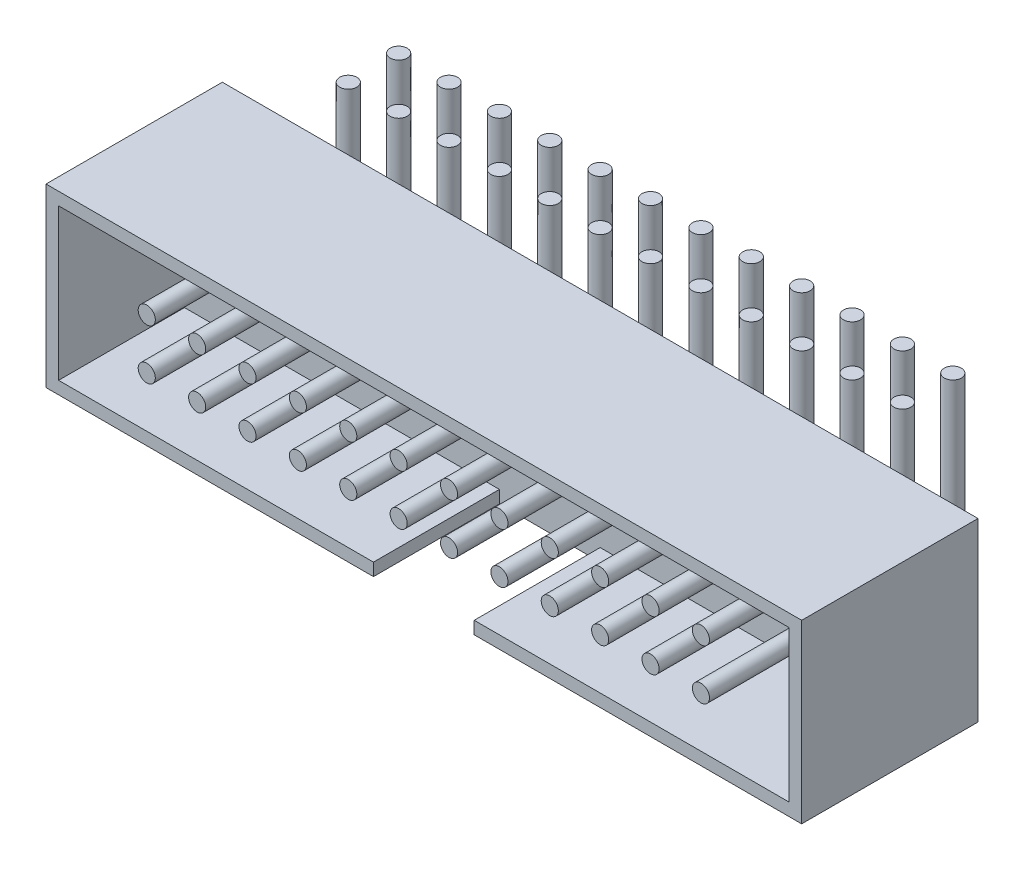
ISO-10303-21;
HEADER;
FILE_DESCRIPTION(('STEP AP214'),'2;1');
FILE_NAME('part.step','',(''),(''),'','','');
FILE_SCHEMA(('AUTOMOTIVE_DESIGN { 1 0 10303 214 1 1 1 1 }'));
ENDSEC;
DATA;
#1=APPLICATION_CONTEXT('core data for automotive mechanical design processes');
#2=APPLICATION_PROTOCOL_DEFINITION('international standard','automotive_design',2000,#1);
#3=PRODUCT_CONTEXT('',#1,'mechanical');
#4=PRODUCT('Part','Part','',(#3));
#5=PRODUCT_RELATED_PRODUCT_CATEGORY('part','',(#4));
#6=PRODUCT_DEFINITION_FORMATION('','',#4);
#7=PRODUCT_DEFINITION_CONTEXT('part definition',#1,'design');
#8=PRODUCT_DEFINITION('design','',#6,#7);
#9=PRODUCT_DEFINITION_SHAPE('','',#8);
#10=(LENGTH_UNIT() NAMED_UNIT(*) SI_UNIT(.MILLI.,.METRE.));
#11=(NAMED_UNIT(*) PLANE_ANGLE_UNIT() SI_UNIT($,.RADIAN.));
#12=(NAMED_UNIT(*) SI_UNIT($,.STERADIAN.) SOLID_ANGLE_UNIT());
#13=UNCERTAINTY_MEASURE_WITH_UNIT(LENGTH_MEASURE(1.E-05),#10,'distance_accuracy_value','');
#14=(GEOMETRIC_REPRESENTATION_CONTEXT(3) GLOBAL_UNCERTAINTY_ASSIGNED_CONTEXT((#13)) GLOBAL_UNIT_ASSIGNED_CONTEXT((#10,
#11,#12)) REPRESENTATION_CONTEXT('',''));
#15=CARTESIAN_POINT('',(0.,0.,0.));
#16=DIRECTION('',(0.,0.,1.));
#17=DIRECTION('',(1.,0.,0.));
#18=AXIS2_PLACEMENT_3D('',#15,#16,#17);
#19=CARTESIAN_POINT('',(12.7928430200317,2.54,-1.27));
#20=DIRECTION('',(0.,1.,0.));
#21=DIRECTION('',(0.,0.,1.));
#22=AXIS2_PLACEMENT_3D('',#19,#20,#21);
#23=PLANE('',#22);
#24=CARTESIAN_POINT('',(27.94,2.54,-1.27));
#25=DIRECTION('',(0.,1.,0.));
#26=DIRECTION('',(0.,0.,1.));
#27=AXIS2_PLACEMENT_3D('',#24,#25,#26);
#28=CIRCLE('',#27,0.4318);
#29=CARTESIAN_POINT('',(27.94,2.54,-0.8382));
#30=VERTEX_POINT('',#29);
#31=EDGE_CURVE('E70',#30,#30,#28,.T.);
#32=ORIENTED_EDGE('',*,*,#31,.F.);
#33=EDGE_LOOP('',(#32));
#34=FACE_BOUND('',#33,.T.);
#35=ADVANCED_FACE('F64',(#34),#23,.F.);
#36=CARTESIAN_POINT('',(12.7928430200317,7.62,-1.27));
#37=DIRECTION('',(0.,1.,0.));
#38=DIRECTION('',(0.,0.,1.));
#39=AXIS2_PLACEMENT_3D('',#36,#37,#38);
#40=PLANE('',#39);
#41=CARTESIAN_POINT('',(27.94,7.62,-1.27));
#42=DIRECTION('',(0.,1.,0.));
#43=DIRECTION('',(0.,0.,1.));
#44=AXIS2_PLACEMENT_3D('',#41,#42,#43);
#45=CIRCLE('',#44,0.4318);
#46=CARTESIAN_POINT('',(27.94,7.62,-0.8382));
#47=VERTEX_POINT('',#46);
#48=EDGE_CURVE('E12',#47,#47,#45,.T.);
#49=ORIENTED_EDGE('',*,*,#48,.T.);
#50=EDGE_LOOP('',(#49));
#51=FACE_BOUND('',#50,.T.);
#52=ADVANCED_FACE('F80',(#51),#40,.T.);
#53=CARTESIAN_POINT('',(27.94,2.54,-1.27));
#54=DIRECTION('',(0.,1.,0.));
#55=DIRECTION('',(0.,0.,1.));
#56=AXIS2_PLACEMENT_3D('',#53,#54,#55);
#57=CYLINDRICAL_SURFACE('',#56,0.4318);
#58=ORIENTED_EDGE('',*,*,#31,.T.);
#59=EDGE_LOOP('',(#58));
#60=FACE_BOUND('',#59,.T.);
#61=ORIENTED_EDGE('',*,*,#48,.F.);
#62=EDGE_LOOP('',(#61));
#63=FACE_BOUND('',#62,.T.);
#64=ADVANCED_FACE('F76',(#60,#63),#57,.T.);
#65=CLOSED_SHELL('',(#35,#52,#64));
#66=MANIFOLD_SOLID_BREP('B2',#65);
#67=CARTESIAN_POINT('',(10.2528430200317,2.54,-1.27));
#68=DIRECTION('',(0.,1.,0.));
#69=DIRECTION('',(0.,0.,1.));
#70=AXIS2_PLACEMENT_3D('',#67,#68,#69);
#71=PLANE('',#70);
#72=CARTESIAN_POINT('',(25.4,2.54,-1.27));
#73=DIRECTION('',(0.,1.,0.));
#74=DIRECTION('',(0.,0.,1.));
#75=AXIS2_PLACEMENT_3D('',#72,#73,#74);
#76=CIRCLE('',#75,0.4318);
#77=CARTESIAN_POINT('',(25.4,2.54,-0.8382));
#78=VERTEX_POINT('',#77);
#79=EDGE_CURVE('E119',#78,#78,#76,.T.);
#80=ORIENTED_EDGE('',*,*,#79,.F.);
#81=EDGE_LOOP('',(#80));
#82=FACE_BOUND('',#81,.T.);
#83=ADVANCED_FACE('F113',(#82),#71,.F.);
#84=CARTESIAN_POINT('',(10.2528430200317,7.62,-1.27));
#85=DIRECTION('',(0.,1.,0.));
#86=DIRECTION('',(0.,0.,1.));
#87=AXIS2_PLACEMENT_3D('',#84,#85,#86);
#88=PLANE('',#87);
#89=CARTESIAN_POINT('',(25.4,7.62,-1.27));
#90=DIRECTION('',(0.,1.,0.));
#91=DIRECTION('',(0.,0.,1.));
#92=AXIS2_PLACEMENT_3D('',#89,#90,#91);
#93=CIRCLE('',#92,0.4318);
#94=CARTESIAN_POINT('',(25.4,7.62,-0.8382));
#95=VERTEX_POINT('',#94);
#96=EDGE_CURVE('E63',#95,#95,#93,.T.);
#97=ORIENTED_EDGE('',*,*,#96,.T.);
#98=EDGE_LOOP('',(#97));
#99=FACE_BOUND('',#98,.T.);
#100=ADVANCED_FACE('F129',(#99),#88,.T.);
#101=CARTESIAN_POINT('',(25.4,2.54,-1.27));
#102=DIRECTION('',(0.,1.,0.));
#103=DIRECTION('',(0.,0.,1.));
#104=AXIS2_PLACEMENT_3D('',#101,#102,#103);
#105=CYLINDRICAL_SURFACE('',#104,0.4318);
#106=ORIENTED_EDGE('',*,*,#79,.T.);
#107=EDGE_LOOP('',(#106));
#108=FACE_BOUND('',#107,.T.);
#109=ORIENTED_EDGE('',*,*,#96,.F.);
#110=EDGE_LOOP('',(#109));
#111=FACE_BOUND('',#110,.T.);
#112=ADVANCED_FACE('F125',(#108,#111),#105,.T.);
#113=CLOSED_SHELL('',(#83,#100,#112));
#114=MANIFOLD_SOLID_BREP('B7',#113);
#115=CARTESIAN_POINT('',(7.71284302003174,2.54,-1.27));
#116=DIRECTION('',(0.,1.,0.));
#117=DIRECTION('',(0.,0.,1.));
#118=AXIS2_PLACEMENT_3D('',#115,#116,#117);
#119=PLANE('',#118);
#120=CARTESIAN_POINT('',(22.86,2.54,-1.27));
#121=DIRECTION('',(0.,1.,0.));
#122=DIRECTION('',(0.,0.,1.));
#123=AXIS2_PLACEMENT_3D('',#120,#121,#122);
#124=CIRCLE('',#123,0.4318);
#125=CARTESIAN_POINT('',(22.86,2.54,-0.8382));
#126=VERTEX_POINT('',#125);
#127=EDGE_CURVE('E168',#126,#126,#124,.T.);
#128=ORIENTED_EDGE('',*,*,#127,.F.);
#129=EDGE_LOOP('',(#128));
#130=FACE_BOUND('',#129,.T.);
#131=ADVANCED_FACE('F162',(#130),#119,.F.);
#132=CARTESIAN_POINT('',(7.71284302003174,7.62,-1.27));
#133=DIRECTION('',(0.,1.,0.));
#134=DIRECTION('',(0.,0.,1.));
#135=AXIS2_PLACEMENT_3D('',#132,#133,#134);
#136=PLANE('',#135);
#137=CARTESIAN_POINT('',(22.86,7.62,-1.27));
#138=DIRECTION('',(0.,1.,0.));
#139=DIRECTION('',(0.,0.,1.));
#140=AXIS2_PLACEMENT_3D('',#137,#138,#139);
#141=CIRCLE('',#140,0.4318);
#142=CARTESIAN_POINT('',(22.86,7.62,-0.8382));
#143=VERTEX_POINT('',#142);
#144=EDGE_CURVE('E112',#143,#143,#141,.T.);
#145=ORIENTED_EDGE('',*,*,#144,.T.);
#146=EDGE_LOOP('',(#145));
#147=FACE_BOUND('',#146,.T.);
#148=ADVANCED_FACE('F178',(#147),#136,.T.);
#149=CARTESIAN_POINT('',(22.86,2.54,-1.27));
#150=DIRECTION('',(0.,1.,0.));
#151=DIRECTION('',(0.,0.,1.));
#152=AXIS2_PLACEMENT_3D('',#149,#150,#151);
#153=CYLINDRICAL_SURFACE('',#152,0.4318);
#154=ORIENTED_EDGE('',*,*,#127,.T.);
#155=EDGE_LOOP('',(#154));
#156=FACE_BOUND('',#155,.T.);
#157=ORIENTED_EDGE('',*,*,#144,.F.);
#158=EDGE_LOOP('',(#157));
#159=FACE_BOUND('',#158,.T.);
#160=ADVANCED_FACE('F174',(#156,#159),#153,.T.);
#161=CLOSED_SHELL('',(#131,#148,#160));
#162=MANIFOLD_SOLID_BREP('B58',#161);
#163=CARTESIAN_POINT('',(5.17284302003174,2.54,-1.27));
#164=DIRECTION('',(0.,1.,0.));
#165=DIRECTION('',(0.,0.,1.));
#166=AXIS2_PLACEMENT_3D('',#163,#164,#165);
#167=PLANE('',#166);
#168=CARTESIAN_POINT('',(20.32,2.54,-1.27));
#169=DIRECTION('',(0.,1.,0.));
#170=DIRECTION('',(0.,0.,1.));
#171=AXIS2_PLACEMENT_3D('',#168,#169,#170);
#172=CIRCLE('',#171,0.4318);
#173=CARTESIAN_POINT('',(20.32,2.54,-0.8382));
#174=VERTEX_POINT('',#173);
#175=EDGE_CURVE('E217',#174,#174,#172,.T.);
#176=ORIENTED_EDGE('',*,*,#175,.F.);
#177=EDGE_LOOP('',(#176));
#178=FACE_BOUND('',#177,.T.);
#179=ADVANCED_FACE('F211',(#178),#167,.F.);
#180=CARTESIAN_POINT('',(5.17284302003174,7.62,-1.27));
#181=DIRECTION('',(0.,1.,0.));
#182=DIRECTION('',(0.,0.,1.));
#183=AXIS2_PLACEMENT_3D('',#180,#181,#182);
#184=PLANE('',#183);
#185=CARTESIAN_POINT('',(20.32,7.62,-1.27));
#186=DIRECTION('',(0.,1.,0.));
#187=DIRECTION('',(0.,0.,1.));
#188=AXIS2_PLACEMENT_3D('',#185,#186,#187);
#189=CIRCLE('',#188,0.4318);
#190=CARTESIAN_POINT('',(20.32,7.62,-0.8382));
#191=VERTEX_POINT('',#190);
#192=EDGE_CURVE('E161',#191,#191,#189,.T.);
#193=ORIENTED_EDGE('',*,*,#192,.T.);
#194=EDGE_LOOP('',(#193));
#195=FACE_BOUND('',#194,.T.);
#196=ADVANCED_FACE('F227',(#195),#184,.T.);
#197=CARTESIAN_POINT('',(20.32,2.54,-1.27));
#198=DIRECTION('',(0.,1.,0.));
#199=DIRECTION('',(0.,0.,1.));
#200=AXIS2_PLACEMENT_3D('',#197,#198,#199);
#201=CYLINDRICAL_SURFACE('',#200,0.4318);
#202=ORIENTED_EDGE('',*,*,#175,.T.);
#203=EDGE_LOOP('',(#202));
#204=FACE_BOUND('',#203,.T.);
#205=ORIENTED_EDGE('',*,*,#192,.F.);
#206=EDGE_LOOP('',(#205));
#207=FACE_BOUND('',#206,.T.);
#208=ADVANCED_FACE('F223',(#204,#207),#201,.T.);
#209=CLOSED_SHELL('',(#179,#196,#208));
#210=MANIFOLD_SOLID_BREP('B107',#209);
#211=CARTESIAN_POINT('',(2.63284302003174,2.54,-1.27));
#212=DIRECTION('',(0.,1.,0.));
#213=DIRECTION('',(0.,0.,1.));
#214=AXIS2_PLACEMENT_3D('',#211,#212,#213);
#215=PLANE('',#214);
#216=CARTESIAN_POINT('',(17.78,2.54,-1.27));
#217=DIRECTION('',(0.,1.,0.));
#218=DIRECTION('',(0.,0.,1.));
#219=AXIS2_PLACEMENT_3D('',#216,#217,#218);
#220=CIRCLE('',#219,0.4318);
#221=CARTESIAN_POINT('',(17.78,2.54,-0.8382));
#222=VERTEX_POINT('',#221);
#223=EDGE_CURVE('E266',#222,#222,#220,.T.);
#224=ORIENTED_EDGE('',*,*,#223,.F.);
#225=EDGE_LOOP('',(#224));
#226=FACE_BOUND('',#225,.T.);
#227=ADVANCED_FACE('F260',(#226),#215,.F.);
#228=CARTESIAN_POINT('',(2.63284302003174,7.62,-1.27));
#229=DIRECTION('',(0.,1.,0.));
#230=DIRECTION('',(0.,0.,1.));
#231=AXIS2_PLACEMENT_3D('',#228,#229,#230);
#232=PLANE('',#231);
#233=CARTESIAN_POINT('',(17.78,7.62,-1.27));
#234=DIRECTION('',(0.,1.,0.));
#235=DIRECTION('',(0.,0.,1.));
#236=AXIS2_PLACEMENT_3D('',#233,#234,#235);
#237=CIRCLE('',#236,0.4318);
#238=CARTESIAN_POINT('',(17.78,7.62,-0.8382));
#239=VERTEX_POINT('',#238);
#240=EDGE_CURVE('E210',#239,#239,#237,.T.);
#241=ORIENTED_EDGE('',*,*,#240,.T.);
#242=EDGE_LOOP('',(#241));
#243=FACE_BOUND('',#242,.T.);
#244=ADVANCED_FACE('F276',(#243),#232,.T.);
#245=CARTESIAN_POINT('',(17.78,2.54,-1.27));
#246=DIRECTION('',(0.,1.,0.));
#247=DIRECTION('',(0.,0.,1.));
#248=AXIS2_PLACEMENT_3D('',#245,#246,#247);
#249=CYLINDRICAL_SURFACE('',#248,0.4318);
#250=ORIENTED_EDGE('',*,*,#223,.T.);
#251=EDGE_LOOP('',(#250));
#252=FACE_BOUND('',#251,.T.);
#253=ORIENTED_EDGE('',*,*,#240,.F.);
#254=EDGE_LOOP('',(#253));
#255=FACE_BOUND('',#254,.T.);
#256=ADVANCED_FACE('F272',(#252,#255),#249,.T.);
#257=CLOSED_SHELL('',(#227,#244,#256));
#258=MANIFOLD_SOLID_BREP('B156',#257);
#259=CARTESIAN_POINT('',(0.0928430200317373,2.54,-1.27));
#260=DIRECTION('',(0.,1.,0.));
#261=DIRECTION('',(0.,0.,1.));
#262=AXIS2_PLACEMENT_3D('',#259,#260,#261);
#263=PLANE('',#262);
#264=CARTESIAN_POINT('',(15.24,2.54,-1.27));
#265=DIRECTION('',(0.,1.,0.));
#266=DIRECTION('',(0.,0.,1.));
#267=AXIS2_PLACEMENT_3D('',#264,#265,#266);
#268=CIRCLE('',#267,0.431800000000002);
#269=CARTESIAN_POINT('',(15.24,2.54,-0.838199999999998));
#270=VERTEX_POINT('',#269);
#271=EDGE_CURVE('E315',#270,#270,#268,.T.);
#272=ORIENTED_EDGE('',*,*,#271,.F.);
#273=EDGE_LOOP('',(#272));
#274=FACE_BOUND('',#273,.T.);
#275=ADVANCED_FACE('F309',(#274),#263,.F.);
#276=CARTESIAN_POINT('',(0.0928430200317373,7.62,-1.27));
#277=DIRECTION('',(0.,1.,0.));
#278=DIRECTION('',(0.,0.,1.));
#279=AXIS2_PLACEMENT_3D('',#276,#277,#278);
#280=PLANE('',#279);
#281=CARTESIAN_POINT('',(15.24,7.62,-1.27));
#282=DIRECTION('',(0.,1.,0.));
#283=DIRECTION('',(0.,0.,1.));
#284=AXIS2_PLACEMENT_3D('',#281,#282,#283);
#285=CIRCLE('',#284,0.431800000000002);
#286=CARTESIAN_POINT('',(15.24,7.62,-0.838199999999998));
#287=VERTEX_POINT('',#286);
#288=EDGE_CURVE('E259',#287,#287,#285,.T.);
#289=ORIENTED_EDGE('',*,*,#288,.T.);
#290=EDGE_LOOP('',(#289));
#291=FACE_BOUND('',#290,.T.);
#292=ADVANCED_FACE('F325',(#291),#280,.T.);
#293=CARTESIAN_POINT('',(15.24,2.54,-1.27));
#294=DIRECTION('',(0.,1.,0.));
#295=DIRECTION('',(0.,0.,1.));
#296=AXIS2_PLACEMENT_3D('',#293,#294,#295);
#297=CYLINDRICAL_SURFACE('',#296,0.431800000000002);
#298=ORIENTED_EDGE('',*,*,#271,.T.);
#299=EDGE_LOOP('',(#298));
#300=FACE_BOUND('',#299,.T.);
#301=ORIENTED_EDGE('',*,*,#288,.F.);
#302=EDGE_LOOP('',(#301));
#303=FACE_BOUND('',#302,.T.);
#304=ADVANCED_FACE('F321',(#300,#303),#297,.T.);
#305=CLOSED_SHELL('',(#275,#292,#304));
#306=MANIFOLD_SOLID_BREP('B205',#305);
#307=CARTESIAN_POINT('',(-2.44715697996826,2.54,-1.27));
#308=DIRECTION('',(0.,1.,0.));
#309=DIRECTION('',(0.,0.,1.));
#310=AXIS2_PLACEMENT_3D('',#307,#308,#309);
#311=PLANE('',#310);
#312=CARTESIAN_POINT('',(12.7,2.54,-1.27));
#313=DIRECTION('',(0.,1.,0.));
#314=DIRECTION('',(0.,0.,1.));
#315=AXIS2_PLACEMENT_3D('',#312,#313,#314);
#316=CIRCLE('',#315,0.4318);
#317=CARTESIAN_POINT('',(12.7,2.54,-0.8382));
#318=VERTEX_POINT('',#317);
#319=EDGE_CURVE('E364',#318,#318,#316,.T.);
#320=ORIENTED_EDGE('',*,*,#319,.F.);
#321=EDGE_LOOP('',(#320));
#322=FACE_BOUND('',#321,.T.);
#323=ADVANCED_FACE('F358',(#322),#311,.F.);
#324=CARTESIAN_POINT('',(-2.44715697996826,7.62,-1.27));
#325=DIRECTION('',(0.,1.,0.));
#326=DIRECTION('',(0.,0.,1.));
#327=AXIS2_PLACEMENT_3D('',#324,#325,#326);
#328=PLANE('',#327);
#329=CARTESIAN_POINT('',(12.7,7.62,-1.27));
#330=DIRECTION('',(0.,1.,0.));
#331=DIRECTION('',(0.,0.,1.));
#332=AXIS2_PLACEMENT_3D('',#329,#330,#331);
#333=CIRCLE('',#332,0.4318);
#334=CARTESIAN_POINT('',(12.7,7.62,-0.8382));
#335=VERTEX_POINT('',#334);
#336=EDGE_CURVE('E308',#335,#335,#333,.T.);
#337=ORIENTED_EDGE('',*,*,#336,.T.);
#338=EDGE_LOOP('',(#337));
#339=FACE_BOUND('',#338,.T.);
#340=ADVANCED_FACE('F374',(#339),#328,.T.);
#341=CARTESIAN_POINT('',(12.7,2.54,-1.27));
#342=DIRECTION('',(0.,1.,0.));
#343=DIRECTION('',(0.,0.,1.));
#344=AXIS2_PLACEMENT_3D('',#341,#342,#343);
#345=CYLINDRICAL_SURFACE('',#344,0.4318);
#346=ORIENTED_EDGE('',*,*,#319,.T.);
#347=EDGE_LOOP('',(#346));
#348=FACE_BOUND('',#347,.T.);
#349=ORIENTED_EDGE('',*,*,#336,.F.);
#350=EDGE_LOOP('',(#349));
#351=FACE_BOUND('',#350,.T.);
#352=ADVANCED_FACE('F370',(#348,#351),#345,.T.);
#353=CLOSED_SHELL('',(#323,#340,#352));
#354=MANIFOLD_SOLID_BREP('B254',#353);
#355=CARTESIAN_POINT('',(-4.98715697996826,2.54,-1.27));
#356=DIRECTION('',(0.,1.,0.));
#357=DIRECTION('',(0.,0.,1.));
#358=AXIS2_PLACEMENT_3D('',#355,#356,#357);
#359=PLANE('',#358);
#360=CARTESIAN_POINT('',(10.16,2.54,-1.27));
#361=DIRECTION('',(0.,1.,0.));
#362=DIRECTION('',(0.,0.,1.));
#363=AXIS2_PLACEMENT_3D('',#360,#361,#362);
#364=CIRCLE('',#363,0.4318);
#365=CARTESIAN_POINT('',(10.16,2.54,-0.8382));
#366=VERTEX_POINT('',#365);
#367=EDGE_CURVE('E413',#366,#366,#364,.T.);
#368=ORIENTED_EDGE('',*,*,#367,.F.);
#369=EDGE_LOOP('',(#368));
#370=FACE_BOUND('',#369,.T.);
#371=ADVANCED_FACE('F407',(#370),#359,.F.);
#372=CARTESIAN_POINT('',(-4.98715697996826,7.62,-1.27));
#373=DIRECTION('',(0.,1.,0.));
#374=DIRECTION('',(0.,0.,1.));
#375=AXIS2_PLACEMENT_3D('',#372,#373,#374);
#376=PLANE('',#375);
#377=CARTESIAN_POINT('',(10.16,7.62,-1.27));
#378=DIRECTION('',(0.,1.,0.));
#379=DIRECTION('',(0.,0.,1.));
#380=AXIS2_PLACEMENT_3D('',#377,#378,#379);
#381=CIRCLE('',#380,0.4318);
#382=CARTESIAN_POINT('',(10.16,7.62,-0.8382));
#383=VERTEX_POINT('',#382);
#384=EDGE_CURVE('E357',#383,#383,#381,.T.);
#385=ORIENTED_EDGE('',*,*,#384,.T.);
#386=EDGE_LOOP('',(#385));
#387=FACE_BOUND('',#386,.T.);
#388=ADVANCED_FACE('F423',(#387),#376,.T.);
#389=CARTESIAN_POINT('',(10.16,2.54,-1.27));
#390=DIRECTION('',(0.,1.,0.));
#391=DIRECTION('',(0.,0.,1.));
#392=AXIS2_PLACEMENT_3D('',#389,#390,#391);
#393=CYLINDRICAL_SURFACE('',#392,0.4318);
#394=ORIENTED_EDGE('',*,*,#367,.T.);
#395=EDGE_LOOP('',(#394));
#396=FACE_BOUND('',#395,.T.);
#397=ORIENTED_EDGE('',*,*,#384,.F.);
#398=EDGE_LOOP('',(#397));
#399=FACE_BOUND('',#398,.T.);
#400=ADVANCED_FACE('F419',(#396,#399),#393,.T.);
#401=CLOSED_SHELL('',(#371,#388,#400));
#402=MANIFOLD_SOLID_BREP('B303',#401);
#403=CARTESIAN_POINT('',(-7.52715697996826,2.54,-1.27));
#404=DIRECTION('',(0.,1.,0.));
#405=DIRECTION('',(0.,0.,1.));
#406=AXIS2_PLACEMENT_3D('',#403,#404,#405);
#407=PLANE('',#406);
#408=CARTESIAN_POINT('',(7.62,2.54,-1.27));
#409=DIRECTION('',(0.,1.,0.));
#410=DIRECTION('',(0.,0.,1.));
#411=AXIS2_PLACEMENT_3D('',#408,#409,#410);
#412=CIRCLE('',#411,0.431800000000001);
#413=CARTESIAN_POINT('',(7.62,2.54,-0.838199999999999));
#414=VERTEX_POINT('',#413);
#415=EDGE_CURVE('E462',#414,#414,#412,.T.);
#416=ORIENTED_EDGE('',*,*,#415,.F.);
#417=EDGE_LOOP('',(#416));
#418=FACE_BOUND('',#417,.T.);
#419=ADVANCED_FACE('F456',(#418),#407,.F.);
#420=CARTESIAN_POINT('',(-7.52715697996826,7.62,-1.27));
#421=DIRECTION('',(0.,1.,0.));
#422=DIRECTION('',(0.,0.,1.));
#423=AXIS2_PLACEMENT_3D('',#420,#421,#422);
#424=PLANE('',#423);
#425=CARTESIAN_POINT('',(7.62,7.62,-1.27));
#426=DIRECTION('',(0.,1.,0.));
#427=DIRECTION('',(0.,0.,1.));
#428=AXIS2_PLACEMENT_3D('',#425,#426,#427);
#429=CIRCLE('',#428,0.431800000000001);
#430=CARTESIAN_POINT('',(7.62,7.62,-0.838199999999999));
#431=VERTEX_POINT('',#430);
#432=EDGE_CURVE('E406',#431,#431,#429,.T.);
#433=ORIENTED_EDGE('',*,*,#432,.T.);
#434=EDGE_LOOP('',(#433));
#435=FACE_BOUND('',#434,.T.);
#436=ADVANCED_FACE('F472',(#435),#424,.T.);
#437=CARTESIAN_POINT('',(7.62,2.54,-1.27));
#438=DIRECTION('',(0.,1.,0.));
#439=DIRECTION('',(0.,0.,1.));
#440=AXIS2_PLACEMENT_3D('',#437,#438,#439);
#441=CYLINDRICAL_SURFACE('',#440,0.431800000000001);
#442=ORIENTED_EDGE('',*,*,#415,.T.);
#443=EDGE_LOOP('',(#442));
#444=FACE_BOUND('',#443,.T.);
#445=ORIENTED_EDGE('',*,*,#432,.F.);
#446=EDGE_LOOP('',(#445));
#447=FACE_BOUND('',#446,.T.);
#448=ADVANCED_FACE('F468',(#444,#447),#441,.T.);
#449=CLOSED_SHELL('',(#419,#436,#448));
#450=MANIFOLD_SOLID_BREP('B352',#449);
#451=CARTESIAN_POINT('',(-10.0671569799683,2.54,-1.27));
#452=DIRECTION('',(0.,1.,0.));
#453=DIRECTION('',(0.,0.,1.));
#454=AXIS2_PLACEMENT_3D('',#451,#452,#453);
#455=PLANE('',#454);
#456=CARTESIAN_POINT('',(5.08,2.54,-1.27));
#457=DIRECTION('',(0.,1.,0.));
#458=DIRECTION('',(0.,0.,1.));
#459=AXIS2_PLACEMENT_3D('',#456,#457,#458);
#460=CIRCLE('',#459,0.4318);
#461=CARTESIAN_POINT('',(5.08,2.54,-0.8382));
#462=VERTEX_POINT('',#461);
#463=EDGE_CURVE('E511',#462,#462,#460,.T.);
#464=ORIENTED_EDGE('',*,*,#463,.F.);
#465=EDGE_LOOP('',(#464));
#466=FACE_BOUND('',#465,.T.);
#467=ADVANCED_FACE('F505',(#466),#455,.F.);
#468=CARTESIAN_POINT('',(-10.0671569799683,7.62,-1.27));
#469=DIRECTION('',(0.,1.,0.));
#470=DIRECTION('',(0.,0.,1.));
#471=AXIS2_PLACEMENT_3D('',#468,#469,#470);
#472=PLANE('',#471);
#473=CARTESIAN_POINT('',(5.08,7.62,-1.27));
#474=DIRECTION('',(0.,1.,0.));
#475=DIRECTION('',(0.,0.,1.));
#476=AXIS2_PLACEMENT_3D('',#473,#474,#475);
#477=CIRCLE('',#476,0.4318);
#478=CARTESIAN_POINT('',(5.08,7.62,-0.8382));
#479=VERTEX_POINT('',#478);
#480=EDGE_CURVE('E455',#479,#479,#477,.T.);
#481=ORIENTED_EDGE('',*,*,#480,.T.);
#482=EDGE_LOOP('',(#481));
#483=FACE_BOUND('',#482,.T.);
#484=ADVANCED_FACE('F521',(#483),#472,.T.);
#485=CARTESIAN_POINT('',(5.08,2.54,-1.27));
#486=DIRECTION('',(0.,1.,0.));
#487=DIRECTION('',(0.,0.,1.));
#488=AXIS2_PLACEMENT_3D('',#485,#486,#487);
#489=CYLINDRICAL_SURFACE('',#488,0.4318);
#490=ORIENTED_EDGE('',*,*,#463,.T.);
#491=EDGE_LOOP('',(#490));
#492=FACE_BOUND('',#491,.T.);
#493=ORIENTED_EDGE('',*,*,#480,.F.);
#494=EDGE_LOOP('',(#493));
#495=FACE_BOUND('',#494,.T.);
#496=ADVANCED_FACE('F517',(#492,#495),#489,.T.);
#497=CLOSED_SHELL('',(#467,#484,#496));
#498=MANIFOLD_SOLID_BREP('B401',#497);
#499=CARTESIAN_POINT('',(-12.6071569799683,2.54,-1.27));
#500=DIRECTION('',(0.,1.,0.));
#501=DIRECTION('',(0.,0.,1.));
#502=AXIS2_PLACEMENT_3D('',#499,#500,#501);
#503=PLANE('',#502);
#504=CARTESIAN_POINT('',(2.54,2.54,-1.27));
#505=DIRECTION('',(0.,1.,0.));
#506=DIRECTION('',(0.,0.,1.));
#507=AXIS2_PLACEMENT_3D('',#504,#505,#506);
#508=CIRCLE('',#507,0.4318);
#509=CARTESIAN_POINT('',(2.54,2.54,-0.8382));
#510=VERTEX_POINT('',#509);
#511=EDGE_CURVE('E560',#510,#510,#508,.T.);
#512=ORIENTED_EDGE('',*,*,#511,.F.);
#513=EDGE_LOOP('',(#512));
#514=FACE_BOUND('',#513,.T.);
#515=ADVANCED_FACE('F554',(#514),#503,.F.);
#516=CARTESIAN_POINT('',(-12.6071569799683,7.62,-1.27));
#517=DIRECTION('',(0.,1.,0.));
#518=DIRECTION('',(0.,0.,1.));
#519=AXIS2_PLACEMENT_3D('',#516,#517,#518);
#520=PLANE('',#519);
#521=CARTESIAN_POINT('',(2.54,7.62,-1.27));
#522=DIRECTION('',(0.,1.,0.));
#523=DIRECTION('',(0.,0.,1.));
#524=AXIS2_PLACEMENT_3D('',#521,#522,#523);
#525=CIRCLE('',#524,0.4318);
#526=CARTESIAN_POINT('',(2.54,7.62,-0.8382));
#527=VERTEX_POINT('',#526);
#528=EDGE_CURVE('E504',#527,#527,#525,.T.);
#529=ORIENTED_EDGE('',*,*,#528,.T.);
#530=EDGE_LOOP('',(#529));
#531=FACE_BOUND('',#530,.T.);
#532=ADVANCED_FACE('F570',(#531),#520,.T.);
#533=CARTESIAN_POINT('',(2.54,2.54,-1.27));
#534=DIRECTION('',(0.,1.,0.));
#535=DIRECTION('',(0.,0.,1.));
#536=AXIS2_PLACEMENT_3D('',#533,#534,#535);
#537=CYLINDRICAL_SURFACE('',#536,0.4318);
#538=ORIENTED_EDGE('',*,*,#511,.T.);
#539=EDGE_LOOP('',(#538));
#540=FACE_BOUND('',#539,.T.);
#541=ORIENTED_EDGE('',*,*,#528,.F.);
#542=EDGE_LOOP('',(#541));
#543=FACE_BOUND('',#542,.T.);
#544=ADVANCED_FACE('F566',(#540,#543),#537,.T.);
#545=CLOSED_SHELL('',(#515,#532,#544));
#546=MANIFOLD_SOLID_BREP('B450',#545);
#547=CARTESIAN_POINT('',(-15.1471569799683,2.54,-1.27));
#548=DIRECTION('',(0.,1.,0.));
#549=DIRECTION('',(0.,0.,1.));
#550=AXIS2_PLACEMENT_3D('',#547,#548,#549);
#551=PLANE('',#550);
#552=CARTESIAN_POINT('',(0.,2.54,-1.27));
#553=DIRECTION('',(0.,1.,0.));
#554=DIRECTION('',(0.,0.,1.));
#555=AXIS2_PLACEMENT_3D('',#552,#553,#554);
#556=CIRCLE('',#555,0.4318);
#557=CARTESIAN_POINT('',(0.,2.54,-0.8382));
#558=VERTEX_POINT('',#557);
#559=EDGE_CURVE('E609',#558,#558,#556,.T.);
#560=ORIENTED_EDGE('',*,*,#559,.F.);
#561=EDGE_LOOP('',(#560));
#562=FACE_BOUND('',#561,.T.);
#563=ADVANCED_FACE('F603',(#562),#551,.F.);
#564=CARTESIAN_POINT('',(-15.1471569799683,7.62,-1.27));
#565=DIRECTION('',(0.,1.,0.));
#566=DIRECTION('',(0.,0.,1.));
#567=AXIS2_PLACEMENT_3D('',#564,#565,#566);
#568=PLANE('',#567);
#569=CARTESIAN_POINT('',(0.,7.62,-1.27));
#570=DIRECTION('',(0.,1.,0.));
#571=DIRECTION('',(0.,0.,1.));
#572=AXIS2_PLACEMENT_3D('',#569,#570,#571);
#573=CIRCLE('',#572,0.4318);
#574=CARTESIAN_POINT('',(0.,7.62,-0.8382));
#575=VERTEX_POINT('',#574);
#576=EDGE_CURVE('E553',#575,#575,#573,.T.);
#577=ORIENTED_EDGE('',*,*,#576,.T.);
#578=EDGE_LOOP('',(#577));
#579=FACE_BOUND('',#578,.T.);
#580=ADVANCED_FACE('F619',(#579),#568,.T.);
#581=CARTESIAN_POINT('',(0.,2.54,-1.27));
#582=DIRECTION('',(0.,1.,0.));
#583=DIRECTION('',(0.,0.,1.));
#584=AXIS2_PLACEMENT_3D('',#581,#582,#583);
#585=CYLINDRICAL_SURFACE('',#584,0.4318);
#586=ORIENTED_EDGE('',*,*,#559,.T.);
#587=EDGE_LOOP('',(#586));
#588=FACE_BOUND('',#587,.T.);
#589=ORIENTED_EDGE('',*,*,#576,.F.);
#590=EDGE_LOOP('',(#589));
#591=FACE_BOUND('',#590,.T.);
#592=ADVANCED_FACE('F615',(#588,#591),#585,.T.);
#593=CLOSED_SHELL('',(#563,#580,#592));
#594=MANIFOLD_SOLID_BREP('B499',#593);
#595=CARTESIAN_POINT('',(12.7928430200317,0.,-3.81));
#596=DIRECTION('',(0.,1.,0.));
#597=DIRECTION('',(0.,0.,1.));
#598=AXIS2_PLACEMENT_3D('',#595,#596,#597);
#599=PLANE('',#598);
#600=CARTESIAN_POINT('',(27.94,0.,-3.81));
#601=DIRECTION('',(0.,1.,0.));
#602=DIRECTION('',(0.,0.,1.));
#603=AXIS2_PLACEMENT_3D('',#600,#601,#602);
#604=CIRCLE('',#603,0.4318);
#605=CARTESIAN_POINT('',(27.94,0.,-3.3782));
#606=VERTEX_POINT('',#605);
#607=EDGE_CURVE('E658',#606,#606,#604,.T.);
#608=ORIENTED_EDGE('',*,*,#607,.F.);
#609=EDGE_LOOP('',(#608));
#610=FACE_BOUND('',#609,.T.);
#611=ADVANCED_FACE('F652',(#610),#599,.F.);
#612=CARTESIAN_POINT('',(12.7928430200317,7.62,-3.81));
#613=DIRECTION('',(0.,1.,0.));
#614=DIRECTION('',(0.,0.,1.));
#615=AXIS2_PLACEMENT_3D('',#612,#613,#614);
#616=PLANE('',#615);
#617=CARTESIAN_POINT('',(27.94,7.62,-3.81));
#618=DIRECTION('',(0.,1.,0.));
#619=DIRECTION('',(0.,0.,1.));
#620=AXIS2_PLACEMENT_3D('',#617,#618,#619);
#621=CIRCLE('',#620,0.4318);
#622=CARTESIAN_POINT('',(27.94,7.62,-3.3782));
#623=VERTEX_POINT('',#622);
#624=EDGE_CURVE('E602',#623,#623,#621,.T.);
#625=ORIENTED_EDGE('',*,*,#624,.T.);
#626=EDGE_LOOP('',(#625));
#627=FACE_BOUND('',#626,.T.);
#628=ADVANCED_FACE('F668',(#627),#616,.T.);
#629=CARTESIAN_POINT('',(27.94,0.,-3.81));
#630=DIRECTION('',(0.,1.,0.));
#631=DIRECTION('',(0.,0.,1.));
#632=AXIS2_PLACEMENT_3D('',#629,#630,#631);
#633=CYLINDRICAL_SURFACE('',#632,0.4318);
#634=ORIENTED_EDGE('',*,*,#607,.T.);
#635=EDGE_LOOP('',(#634));
#636=FACE_BOUND('',#635,.T.);
#637=ORIENTED_EDGE('',*,*,#624,.F.);
#638=EDGE_LOOP('',(#637));
#639=FACE_BOUND('',#638,.T.);
#640=ADVANCED_FACE('F664',(#636,#639),#633,.T.);
#641=CLOSED_SHELL('',(#611,#628,#640));
#642=MANIFOLD_SOLID_BREP('B548',#641);
#643=CARTESIAN_POINT('',(10.2528430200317,0.,-3.81));
#644=DIRECTION('',(0.,1.,0.));
#645=DIRECTION('',(0.,0.,1.));
#646=AXIS2_PLACEMENT_3D('',#643,#644,#645);
#647=PLANE('',#646);
#648=CARTESIAN_POINT('',(25.4,0.,-3.81));
#649=DIRECTION('',(0.,1.,0.));
#650=DIRECTION('',(0.,0.,1.));
#651=AXIS2_PLACEMENT_3D('',#648,#649,#650);
#652=CIRCLE('',#651,0.4318);
#653=CARTESIAN_POINT('',(25.4,0.,-3.3782));
#654=VERTEX_POINT('',#653);
#655=EDGE_CURVE('E707',#654,#654,#652,.T.);
#656=ORIENTED_EDGE('',*,*,#655,.F.);
#657=EDGE_LOOP('',(#656));
#658=FACE_BOUND('',#657,.T.);
#659=ADVANCED_FACE('F701',(#658),#647,.F.);
#660=CARTESIAN_POINT('',(10.2528430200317,7.62,-3.81));
#661=DIRECTION('',(0.,1.,0.));
#662=DIRECTION('',(0.,0.,1.));
#663=AXIS2_PLACEMENT_3D('',#660,#661,#662);
#664=PLANE('',#663);
#665=CARTESIAN_POINT('',(25.4,7.62,-3.81));
#666=DIRECTION('',(0.,1.,0.));
#667=DIRECTION('',(0.,0.,1.));
#668=AXIS2_PLACEMENT_3D('',#665,#666,#667);
#669=CIRCLE('',#668,0.4318);
#670=CARTESIAN_POINT('',(25.4,7.62,-3.3782));
#671=VERTEX_POINT('',#670);
#672=EDGE_CURVE('E651',#671,#671,#669,.T.);
#673=ORIENTED_EDGE('',*,*,#672,.T.);
#674=EDGE_LOOP('',(#673));
#675=FACE_BOUND('',#674,.T.);
#676=ADVANCED_FACE('F717',(#675),#664,.T.);
#677=CARTESIAN_POINT('',(25.4,0.,-3.81));
#678=DIRECTION('',(0.,1.,0.));
#679=DIRECTION('',(0.,0.,1.));
#680=AXIS2_PLACEMENT_3D('',#677,#678,#679);
#681=CYLINDRICAL_SURFACE('',#680,0.4318);
#682=ORIENTED_EDGE('',*,*,#655,.T.);
#683=EDGE_LOOP('',(#682));
#684=FACE_BOUND('',#683,.T.);
#685=ORIENTED_EDGE('',*,*,#672,.F.);
#686=EDGE_LOOP('',(#685));
#687=FACE_BOUND('',#686,.T.);
#688=ADVANCED_FACE('F713',(#684,#687),#681,.T.);
#689=CLOSED_SHELL('',(#659,#676,#688));
#690=MANIFOLD_SOLID_BREP('B597',#689);
#691=CARTESIAN_POINT('',(7.71284302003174,0.,-3.81));
#692=DIRECTION('',(0.,1.,0.));
#693=DIRECTION('',(0.,0.,1.));
#694=AXIS2_PLACEMENT_3D('',#691,#692,#693);
#695=PLANE('',#694);
#696=CARTESIAN_POINT('',(22.86,0.,-3.81));
#697=DIRECTION('',(0.,1.,0.));
#698=DIRECTION('',(0.,0.,1.));
#699=AXIS2_PLACEMENT_3D('',#696,#697,#698);
#700=CIRCLE('',#699,0.4318);
#701=CARTESIAN_POINT('',(22.86,0.,-3.3782));
#702=VERTEX_POINT('',#701);
#703=EDGE_CURVE('E756',#702,#702,#700,.T.);
#704=ORIENTED_EDGE('',*,*,#703,.F.);
#705=EDGE_LOOP('',(#704));
#706=FACE_BOUND('',#705,.T.);
#707=ADVANCED_FACE('F750',(#706),#695,.F.);
#708=CARTESIAN_POINT('',(7.71284302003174,7.62,-3.81));
#709=DIRECTION('',(0.,1.,0.));
#710=DIRECTION('',(0.,0.,1.));
#711=AXIS2_PLACEMENT_3D('',#708,#709,#710);
#712=PLANE('',#711);
#713=CARTESIAN_POINT('',(22.86,7.62,-3.81));
#714=DIRECTION('',(0.,1.,0.));
#715=DIRECTION('',(0.,0.,1.));
#716=AXIS2_PLACEMENT_3D('',#713,#714,#715);
#717=CIRCLE('',#716,0.4318);
#718=CARTESIAN_POINT('',(22.86,7.62,-3.3782));
#719=VERTEX_POINT('',#718);
#720=EDGE_CURVE('E700',#719,#719,#717,.T.);
#721=ORIENTED_EDGE('',*,*,#720,.T.);
#722=EDGE_LOOP('',(#721));
#723=FACE_BOUND('',#722,.T.);
#724=ADVANCED_FACE('F766',(#723),#712,.T.);
#725=CARTESIAN_POINT('',(22.86,0.,-3.81));
#726=DIRECTION('',(0.,1.,0.));
#727=DIRECTION('',(0.,0.,1.));
#728=AXIS2_PLACEMENT_3D('',#725,#726,#727);
#729=CYLINDRICAL_SURFACE('',#728,0.4318);
#730=ORIENTED_EDGE('',*,*,#703,.T.);
#731=EDGE_LOOP('',(#730));
#732=FACE_BOUND('',#731,.T.);
#733=ORIENTED_EDGE('',*,*,#720,.F.);
#734=EDGE_LOOP('',(#733));
#735=FACE_BOUND('',#734,.T.);
#736=ADVANCED_FACE('F762',(#732,#735),#729,.T.);
#737=CLOSED_SHELL('',(#707,#724,#736));
#738=MANIFOLD_SOLID_BREP('B646',#737);
#739=CARTESIAN_POINT('',(5.17284302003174,0.,-3.81));
#740=DIRECTION('',(0.,1.,0.));
#741=DIRECTION('',(0.,0.,1.));
#742=AXIS2_PLACEMENT_3D('',#739,#740,#741);
#743=PLANE('',#742);
#744=CARTESIAN_POINT('',(20.32,0.,-3.81));
#745=DIRECTION('',(0.,1.,0.));
#746=DIRECTION('',(0.,0.,1.));
#747=AXIS2_PLACEMENT_3D('',#744,#745,#746);
#748=CIRCLE('',#747,0.4318);
#749=CARTESIAN_POINT('',(20.32,0.,-3.3782));
#750=VERTEX_POINT('',#749);
#751=EDGE_CURVE('E805',#750,#750,#748,.T.);
#752=ORIENTED_EDGE('',*,*,#751,.F.);
#753=EDGE_LOOP('',(#752));
#754=FACE_BOUND('',#753,.T.);
#755=ADVANCED_FACE('F799',(#754),#743,.F.);
#756=CARTESIAN_POINT('',(5.17284302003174,7.62,-3.81));
#757=DIRECTION('',(0.,1.,0.));
#758=DIRECTION('',(0.,0.,1.));
#759=AXIS2_PLACEMENT_3D('',#756,#757,#758);
#760=PLANE('',#759);
#761=CARTESIAN_POINT('',(20.32,7.62,-3.81));
#762=DIRECTION('',(0.,1.,0.));
#763=DIRECTION('',(0.,0.,1.));
#764=AXIS2_PLACEMENT_3D('',#761,#762,#763);
#765=CIRCLE('',#764,0.4318);
#766=CARTESIAN_POINT('',(20.32,7.62,-3.3782));
#767=VERTEX_POINT('',#766);
#768=EDGE_CURVE('E749',#767,#767,#765,.T.);
#769=ORIENTED_EDGE('',*,*,#768,.T.);
#770=EDGE_LOOP('',(#769));
#771=FACE_BOUND('',#770,.T.);
#772=ADVANCED_FACE('F815',(#771),#760,.T.);
#773=CARTESIAN_POINT('',(20.32,0.,-3.81));
#774=DIRECTION('',(0.,1.,0.));
#775=DIRECTION('',(0.,0.,1.));
#776=AXIS2_PLACEMENT_3D('',#773,#774,#775);
#777=CYLINDRICAL_SURFACE('',#776,0.4318);
#778=ORIENTED_EDGE('',*,*,#751,.T.);
#779=EDGE_LOOP('',(#778));
#780=FACE_BOUND('',#779,.T.);
#781=ORIENTED_EDGE('',*,*,#768,.F.);
#782=EDGE_LOOP('',(#781));
#783=FACE_BOUND('',#782,.T.);
#784=ADVANCED_FACE('F811',(#780,#783),#777,.T.);
#785=CLOSED_SHELL('',(#755,#772,#784));
#786=MANIFOLD_SOLID_BREP('B695',#785);
#787=CARTESIAN_POINT('',(2.63284302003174,0.,-3.81));
#788=DIRECTION('',(0.,1.,0.));
#789=DIRECTION('',(0.,0.,1.));
#790=AXIS2_PLACEMENT_3D('',#787,#788,#789);
#791=PLANE('',#790);
#792=CARTESIAN_POINT('',(17.78,0.,-3.81));
#793=DIRECTION('',(0.,1.,0.));
#794=DIRECTION('',(0.,0.,1.));
#795=AXIS2_PLACEMENT_3D('',#792,#793,#794);
#796=CIRCLE('',#795,0.4318);
#797=CARTESIAN_POINT('',(17.78,0.,-3.3782));
#798=VERTEX_POINT('',#797);
#799=EDGE_CURVE('E854',#798,#798,#796,.T.);
#800=ORIENTED_EDGE('',*,*,#799,.F.);
#801=EDGE_LOOP('',(#800));
#802=FACE_BOUND('',#801,.T.);
#803=ADVANCED_FACE('F848',(#802),#791,.F.);
#804=CARTESIAN_POINT('',(2.63284302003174,7.62,-3.81));
#805=DIRECTION('',(0.,1.,0.));
#806=DIRECTION('',(0.,0.,1.));
#807=AXIS2_PLACEMENT_3D('',#804,#805,#806);
#808=PLANE('',#807);
#809=CARTESIAN_POINT('',(17.78,7.62,-3.81));
#810=DIRECTION('',(0.,1.,0.));
#811=DIRECTION('',(0.,0.,1.));
#812=AXIS2_PLACEMENT_3D('',#809,#810,#811);
#813=CIRCLE('',#812,0.4318);
#814=CARTESIAN_POINT('',(17.78,7.62,-3.3782));
#815=VERTEX_POINT('',#814);
#816=EDGE_CURVE('E798',#815,#815,#813,.T.);
#817=ORIENTED_EDGE('',*,*,#816,.T.);
#818=EDGE_LOOP('',(#817));
#819=FACE_BOUND('',#818,.T.);
#820=ADVANCED_FACE('F864',(#819),#808,.T.);
#821=CARTESIAN_POINT('',(17.78,0.,-3.81));
#822=DIRECTION('',(0.,1.,0.));
#823=DIRECTION('',(0.,0.,1.));
#824=AXIS2_PLACEMENT_3D('',#821,#822,#823);
#825=CYLINDRICAL_SURFACE('',#824,0.4318);
#826=ORIENTED_EDGE('',*,*,#799,.T.);
#827=EDGE_LOOP('',(#826));
#828=FACE_BOUND('',#827,.T.);
#829=ORIENTED_EDGE('',*,*,#816,.F.);
#830=EDGE_LOOP('',(#829));
#831=FACE_BOUND('',#830,.T.);
#832=ADVANCED_FACE('F860',(#828,#831),#825,.T.);
#833=CLOSED_SHELL('',(#803,#820,#832));
#834=MANIFOLD_SOLID_BREP('B744',#833);
#835=CARTESIAN_POINT('',(0.0928430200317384,0.,-3.81));
#836=DIRECTION('',(0.,1.,0.));
#837=DIRECTION('',(0.,0.,1.));
#838=AXIS2_PLACEMENT_3D('',#835,#836,#837);
#839=PLANE('',#838);
#840=CARTESIAN_POINT('',(15.24,0.,-3.81));
#841=DIRECTION('',(0.,1.,0.));
#842=DIRECTION('',(0.,0.,1.));
#843=AXIS2_PLACEMENT_3D('',#840,#841,#842);
#844=CIRCLE('',#843,0.431800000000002);
#845=CARTESIAN_POINT('',(15.24,0.,-3.3782));
#846=VERTEX_POINT('',#845);
#847=EDGE_CURVE('E903',#846,#846,#844,.T.);
#848=ORIENTED_EDGE('',*,*,#847,.F.);
#849=EDGE_LOOP('',(#848));
#850=FACE_BOUND('',#849,.T.);
#851=ADVANCED_FACE('F897',(#850),#839,.F.);
#852=CARTESIAN_POINT('',(0.0928430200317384,7.62,-3.81));
#853=DIRECTION('',(0.,1.,0.));
#854=DIRECTION('',(0.,0.,1.));
#855=AXIS2_PLACEMENT_3D('',#852,#853,#854);
#856=PLANE('',#855);
#857=CARTESIAN_POINT('',(15.24,7.62,-3.81));
#858=DIRECTION('',(0.,1.,0.));
#859=DIRECTION('',(0.,0.,1.));
#860=AXIS2_PLACEMENT_3D('',#857,#858,#859);
#861=CIRCLE('',#860,0.431800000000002);
#862=CARTESIAN_POINT('',(15.24,7.62,-3.3782));
#863=VERTEX_POINT('',#862);
#864=EDGE_CURVE('E847',#863,#863,#861,.T.);
#865=ORIENTED_EDGE('',*,*,#864,.T.);
#866=EDGE_LOOP('',(#865));
#867=FACE_BOUND('',#866,.T.);
#868=ADVANCED_FACE('F913',(#867),#856,.T.);
#869=CARTESIAN_POINT('',(15.24,0.,-3.81));
#870=DIRECTION('',(0.,1.,0.));
#871=DIRECTION('',(0.,0.,1.));
#872=AXIS2_PLACEMENT_3D('',#869,#870,#871);
#873=CYLINDRICAL_SURFACE('',#872,0.431800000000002);
#874=ORIENTED_EDGE('',*,*,#847,.T.);
#875=EDGE_LOOP('',(#874));
#876=FACE_BOUND('',#875,.T.);
#877=ORIENTED_EDGE('',*,*,#864,.F.);
#878=EDGE_LOOP('',(#877));
#879=FACE_BOUND('',#878,.T.);
#880=ADVANCED_FACE('F909',(#876,#879),#873,.T.);
#881=CLOSED_SHELL('',(#851,#868,#880));
#882=MANIFOLD_SOLID_BREP('B793',#881);
#883=CARTESIAN_POINT('',(-2.44715697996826,0.,-3.81));
#884=DIRECTION('',(0.,1.,0.));
#885=DIRECTION('',(0.,0.,1.));
#886=AXIS2_PLACEMENT_3D('',#883,#884,#885);
#887=PLANE('',#886);
#888=CARTESIAN_POINT('',(12.7,0.,-3.81));
#889=DIRECTION('',(0.,1.,0.));
#890=DIRECTION('',(0.,0.,1.));
#891=AXIS2_PLACEMENT_3D('',#888,#889,#890);
#892=CIRCLE('',#891,0.4318);
#893=CARTESIAN_POINT('',(12.7,0.,-3.3782));
#894=VERTEX_POINT('',#893);
#895=EDGE_CURVE('E952',#894,#894,#892,.T.);
#896=ORIENTED_EDGE('',*,*,#895,.F.);
#897=EDGE_LOOP('',(#896));
#898=FACE_BOUND('',#897,.T.);
#899=ADVANCED_FACE('F946',(#898),#887,.F.);
#900=CARTESIAN_POINT('',(-2.44715697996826,7.62,-3.81));
#901=DIRECTION('',(0.,1.,0.));
#902=DIRECTION('',(0.,0.,1.));
#903=AXIS2_PLACEMENT_3D('',#900,#901,#902);
#904=PLANE('',#903);
#905=CARTESIAN_POINT('',(12.7,7.62,-3.81));
#906=DIRECTION('',(0.,1.,0.));
#907=DIRECTION('',(0.,0.,1.));
#908=AXIS2_PLACEMENT_3D('',#905,#906,#907);
#909=CIRCLE('',#908,0.4318);
#910=CARTESIAN_POINT('',(12.7,7.62,-3.3782));
#911=VERTEX_POINT('',#910);
#912=EDGE_CURVE('E896',#911,#911,#909,.T.);
#913=ORIENTED_EDGE('',*,*,#912,.T.);
#914=EDGE_LOOP('',(#913));
#915=FACE_BOUND('',#914,.T.);
#916=ADVANCED_FACE('F962',(#915),#904,.T.);
#917=CARTESIAN_POINT('',(12.7,0.,-3.81));
#918=DIRECTION('',(0.,1.,0.));
#919=DIRECTION('',(0.,0.,1.));
#920=AXIS2_PLACEMENT_3D('',#917,#918,#919);
#921=CYLINDRICAL_SURFACE('',#920,0.4318);
#922=ORIENTED_EDGE('',*,*,#895,.T.);
#923=EDGE_LOOP('',(#922));
#924=FACE_BOUND('',#923,.T.);
#925=ORIENTED_EDGE('',*,*,#912,.F.);
#926=EDGE_LOOP('',(#925));
#927=FACE_BOUND('',#926,.T.);
#928=ADVANCED_FACE('F958',(#924,#927),#921,.T.);
#929=CLOSED_SHELL('',(#899,#916,#928));
#930=MANIFOLD_SOLID_BREP('B842',#929);
#931=CARTESIAN_POINT('',(-4.98715697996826,0.,-3.81));
#932=DIRECTION('',(0.,1.,0.));
#933=DIRECTION('',(0.,0.,1.));
#934=AXIS2_PLACEMENT_3D('',#931,#932,#933);
#935=PLANE('',#934);
#936=CARTESIAN_POINT('',(10.16,0.,-3.81));
#937=DIRECTION('',(0.,1.,0.));
#938=DIRECTION('',(0.,0.,1.));
#939=AXIS2_PLACEMENT_3D('',#936,#937,#938);
#940=CIRCLE('',#939,0.4318);
#941=CARTESIAN_POINT('',(10.16,0.,-3.3782));
#942=VERTEX_POINT('',#941);
#943=EDGE_CURVE('E1001',#942,#942,#940,.T.);
#944=ORIENTED_EDGE('',*,*,#943,.F.);
#945=EDGE_LOOP('',(#944));
#946=FACE_BOUND('',#945,.T.);
#947=ADVANCED_FACE('F995',(#946),#935,.F.);
#948=CARTESIAN_POINT('',(-4.98715697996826,7.62,-3.81));
#949=DIRECTION('',(0.,1.,0.));
#950=DIRECTION('',(0.,0.,1.));
#951=AXIS2_PLACEMENT_3D('',#948,#949,#950);
#952=PLANE('',#951);
#953=CARTESIAN_POINT('',(10.16,7.62,-3.81));
#954=DIRECTION('',(0.,1.,0.));
#955=DIRECTION('',(0.,0.,1.));
#956=AXIS2_PLACEMENT_3D('',#953,#954,#955);
#957=CIRCLE('',#956,0.4318);
#958=CARTESIAN_POINT('',(10.16,7.62,-3.3782));
#959=VERTEX_POINT('',#958);
#960=EDGE_CURVE('E945',#959,#959,#957,.T.);
#961=ORIENTED_EDGE('',*,*,#960,.T.);
#962=EDGE_LOOP('',(#961));
#963=FACE_BOUND('',#962,.T.);
#964=ADVANCED_FACE('F1011',(#963),#952,.T.);
#965=CARTESIAN_POINT('',(10.16,0.,-3.81));
#966=DIRECTION('',(0.,1.,0.));
#967=DIRECTION('',(0.,0.,1.));
#968=AXIS2_PLACEMENT_3D('',#965,#966,#967);
#969=CYLINDRICAL_SURFACE('',#968,0.4318);
#970=ORIENTED_EDGE('',*,*,#943,.T.);
#971=EDGE_LOOP('',(#970));
#972=FACE_BOUND('',#971,.T.);
#973=ORIENTED_EDGE('',*,*,#960,.F.);
#974=EDGE_LOOP('',(#973));
#975=FACE_BOUND('',#974,.T.);
#976=ADVANCED_FACE('F1007',(#972,#975),#969,.T.);
#977=CLOSED_SHELL('',(#947,#964,#976));
#978=MANIFOLD_SOLID_BREP('B891',#977);
#979=CARTESIAN_POINT('',(-7.52715697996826,0.,-3.81));
#980=DIRECTION('',(0.,1.,0.));
#981=DIRECTION('',(0.,0.,1.));
#982=AXIS2_PLACEMENT_3D('',#979,#980,#981);
#983=PLANE('',#982);
#984=CARTESIAN_POINT('',(7.62,0.,-3.81));
#985=DIRECTION('',(0.,1.,0.));
#986=DIRECTION('',(0.,0.,1.));
#987=AXIS2_PLACEMENT_3D('',#984,#985,#986);
#988=CIRCLE('',#987,0.431800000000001);
#989=CARTESIAN_POINT('',(7.62,0.,-3.3782));
#990=VERTEX_POINT('',#989);
#991=EDGE_CURVE('E1050',#990,#990,#988,.T.);
#992=ORIENTED_EDGE('',*,*,#991,.F.);
#993=EDGE_LOOP('',(#992));
#994=FACE_BOUND('',#993,.T.);
#995=ADVANCED_FACE('F1044',(#994),#983,.F.);
#996=CARTESIAN_POINT('',(-7.52715697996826,7.62,-3.81));
#997=DIRECTION('',(0.,1.,0.));
#998=DIRECTION('',(0.,0.,1.));
#999=AXIS2_PLACEMENT_3D('',#996,#997,#998);
#1000=PLANE('',#999);
#1001=CARTESIAN_POINT('',(7.62,7.62,-3.81));
#1002=DIRECTION('',(0.,1.,0.));
#1003=DIRECTION('',(0.,0.,1.));
#1004=AXIS2_PLACEMENT_3D('',#1001,#1002,#1003);
#1005=CIRCLE('',#1004,0.431800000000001);
#1006=CARTESIAN_POINT('',(7.62,7.62,-3.3782));
#1007=VERTEX_POINT('',#1006);
#1008=EDGE_CURVE('E994',#1007,#1007,#1005,.T.);
#1009=ORIENTED_EDGE('',*,*,#1008,.T.);
#1010=EDGE_LOOP('',(#1009));
#1011=FACE_BOUND('',#1010,.T.);
#1012=ADVANCED_FACE('F1060',(#1011),#1000,.T.);
#1013=CARTESIAN_POINT('',(7.62,0.,-3.81));
#1014=DIRECTION('',(0.,1.,0.));
#1015=DIRECTION('',(0.,0.,1.));
#1016=AXIS2_PLACEMENT_3D('',#1013,#1014,#1015);
#1017=CYLINDRICAL_SURFACE('',#1016,0.431800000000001);
#1018=ORIENTED_EDGE('',*,*,#991,.T.);
#1019=EDGE_LOOP('',(#1018));
#1020=FACE_BOUND('',#1019,.T.);
#1021=ORIENTED_EDGE('',*,*,#1008,.F.);
#1022=EDGE_LOOP('',(#1021));
#1023=FACE_BOUND('',#1022,.T.);
#1024=ADVANCED_FACE('F1056',(#1020,#1023),#1017,.T.);
#1025=CLOSED_SHELL('',(#995,#1012,#1024));
#1026=MANIFOLD_SOLID_BREP('B940',#1025);
#1027=CARTESIAN_POINT('',(-10.0671569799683,0.,-3.81));
#1028=DIRECTION('',(0.,1.,0.));
#1029=DIRECTION('',(0.,0.,1.));
#1030=AXIS2_PLACEMENT_3D('',#1027,#1028,#1029);
#1031=PLANE('',#1030);
#1032=CARTESIAN_POINT('',(5.08,0.,-3.81));
#1033=DIRECTION('',(0.,1.,0.));
#1034=DIRECTION('',(0.,0.,1.));
#1035=AXIS2_PLACEMENT_3D('',#1032,#1033,#1034);
#1036=CIRCLE('',#1035,0.4318);
#1037=CARTESIAN_POINT('',(5.08,0.,-3.3782));
#1038=VERTEX_POINT('',#1037);
#1039=EDGE_CURVE('E1099',#1038,#1038,#1036,.T.);
#1040=ORIENTED_EDGE('',*,*,#1039,.F.);
#1041=EDGE_LOOP('',(#1040));
#1042=FACE_BOUND('',#1041,.T.);
#1043=ADVANCED_FACE('F1093',(#1042),#1031,.F.);
#1044=CARTESIAN_POINT('',(-10.0671569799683,7.62,-3.81));
#1045=DIRECTION('',(0.,1.,0.));
#1046=DIRECTION('',(0.,0.,1.));
#1047=AXIS2_PLACEMENT_3D('',#1044,#1045,#1046);
#1048=PLANE('',#1047);
#1049=CARTESIAN_POINT('',(5.08,7.62,-3.81));
#1050=DIRECTION('',(0.,1.,0.));
#1051=DIRECTION('',(0.,0.,1.));
#1052=AXIS2_PLACEMENT_3D('',#1049,#1050,#1051);
#1053=CIRCLE('',#1052,0.4318);
#1054=CARTESIAN_POINT('',(5.08,7.62,-3.3782));
#1055=VERTEX_POINT('',#1054);
#1056=EDGE_CURVE('E1043',#1055,#1055,#1053,.T.);
#1057=ORIENTED_EDGE('',*,*,#1056,.T.);
#1058=EDGE_LOOP('',(#1057));
#1059=FACE_BOUND('',#1058,.T.);
#1060=ADVANCED_FACE('F1109',(#1059),#1048,.T.);
#1061=CARTESIAN_POINT('',(5.08,0.,-3.81));
#1062=DIRECTION('',(0.,1.,0.));
#1063=DIRECTION('',(0.,0.,1.));
#1064=AXIS2_PLACEMENT_3D('',#1061,#1062,#1063);
#1065=CYLINDRICAL_SURFACE('',#1064,0.4318);
#1066=ORIENTED_EDGE('',*,*,#1039,.T.);
#1067=EDGE_LOOP('',(#1066));
#1068=FACE_BOUND('',#1067,.T.);
#1069=ORIENTED_EDGE('',*,*,#1056,.F.);
#1070=EDGE_LOOP('',(#1069));
#1071=FACE_BOUND('',#1070,.T.);
#1072=ADVANCED_FACE('F1105',(#1068,#1071),#1065,.T.);
#1073=CLOSED_SHELL('',(#1043,#1060,#1072));
#1074=MANIFOLD_SOLID_BREP('B989',#1073);
#1075=CARTESIAN_POINT('',(-12.6071569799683,0.,-3.81));
#1076=DIRECTION('',(0.,1.,0.));
#1077=DIRECTION('',(0.,0.,1.));
#1078=AXIS2_PLACEMENT_3D('',#1075,#1076,#1077);
#1079=PLANE('',#1078);
#1080=CARTESIAN_POINT('',(2.54,0.,-3.81));
#1081=DIRECTION('',(0.,1.,0.));
#1082=DIRECTION('',(0.,0.,1.));
#1083=AXIS2_PLACEMENT_3D('',#1080,#1081,#1082);
#1084=CIRCLE('',#1083,0.431800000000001);
#1085=CARTESIAN_POINT('',(2.54,0.,-3.3782));
#1086=VERTEX_POINT('',#1085);
#1087=EDGE_CURVE('E1148',#1086,#1086,#1084,.T.);
#1088=ORIENTED_EDGE('',*,*,#1087,.F.);
#1089=EDGE_LOOP('',(#1088));
#1090=FACE_BOUND('',#1089,.T.);
#1091=ADVANCED_FACE('F1142',(#1090),#1079,.F.);
#1092=CARTESIAN_POINT('',(-12.6071569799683,7.62,-3.81));
#1093=DIRECTION('',(0.,1.,0.));
#1094=DIRECTION('',(0.,0.,1.));
#1095=AXIS2_PLACEMENT_3D('',#1092,#1093,#1094);
#1096=PLANE('',#1095);
#1097=CARTESIAN_POINT('',(2.54,7.62,-3.81));
#1098=DIRECTION('',(0.,1.,0.));
#1099=DIRECTION('',(0.,0.,1.));
#1100=AXIS2_PLACEMENT_3D('',#1097,#1098,#1099);
#1101=CIRCLE('',#1100,0.431800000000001);
#1102=CARTESIAN_POINT('',(2.54,7.62,-3.3782));
#1103=VERTEX_POINT('',#1102);
#1104=EDGE_CURVE('E1092',#1103,#1103,#1101,.T.);
#1105=ORIENTED_EDGE('',*,*,#1104,.T.);
#1106=EDGE_LOOP('',(#1105));
#1107=FACE_BOUND('',#1106,.T.);
#1108=ADVANCED_FACE('F1158',(#1107),#1096,.T.);
#1109=CARTESIAN_POINT('',(2.54,0.,-3.81));
#1110=DIRECTION('',(0.,1.,0.));
#1111=DIRECTION('',(0.,0.,1.));
#1112=AXIS2_PLACEMENT_3D('',#1109,#1110,#1111);
#1113=CYLINDRICAL_SURFACE('',#1112,0.431800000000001);
#1114=ORIENTED_EDGE('',*,*,#1087,.T.);
#1115=EDGE_LOOP('',(#1114));
#1116=FACE_BOUND('',#1115,.T.);
#1117=ORIENTED_EDGE('',*,*,#1104,.F.);
#1118=EDGE_LOOP('',(#1117));
#1119=FACE_BOUND('',#1118,.T.);
#1120=ADVANCED_FACE('F1154',(#1116,#1119),#1113,.T.);
#1121=CLOSED_SHELL('',(#1091,#1108,#1120));
#1122=MANIFOLD_SOLID_BREP('B1038',#1121);
#1123=CARTESIAN_POINT('',(-15.1471569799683,0.,-3.81));
#1124=DIRECTION('',(0.,1.,0.));
#1125=DIRECTION('',(0.,0.,1.));
#1126=AXIS2_PLACEMENT_3D('',#1123,#1124,#1125);
#1127=PLANE('',#1126);
#1128=CARTESIAN_POINT('',(0.,0.,-3.81));
#1129=DIRECTION('',(0.,1.,0.));
#1130=DIRECTION('',(0.,0.,1.));
#1131=AXIS2_PLACEMENT_3D('',#1128,#1129,#1130);
#1132=CIRCLE('',#1131,0.4318);
#1133=CARTESIAN_POINT('',(0.,0.,-3.3782));
#1134=VERTEX_POINT('',#1133);
#1135=EDGE_CURVE('E1197',#1134,#1134,#1132,.T.);
#1136=ORIENTED_EDGE('',*,*,#1135,.F.);
#1137=EDGE_LOOP('',(#1136));
#1138=FACE_BOUND('',#1137,.T.);
#1139=ADVANCED_FACE('F1191',(#1138),#1127,.F.);
#1140=CARTESIAN_POINT('',(-15.1471569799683,7.62,-3.81));
#1141=DIRECTION('',(0.,1.,0.));
#1142=DIRECTION('',(0.,0.,1.));
#1143=AXIS2_PLACEMENT_3D('',#1140,#1141,#1142);
#1144=PLANE('',#1143);
#1145=CARTESIAN_POINT('',(0.,7.62,-3.81));
#1146=DIRECTION('',(0.,1.,0.));
#1147=DIRECTION('',(0.,0.,1.));
#1148=AXIS2_PLACEMENT_3D('',#1145,#1146,#1147);
#1149=CIRCLE('',#1148,0.4318);
#1150=CARTESIAN_POINT('',(0.,7.62,-3.3782));
#1151=VERTEX_POINT('',#1150);
#1152=EDGE_CURVE('E1141',#1151,#1151,#1149,.T.);
#1153=ORIENTED_EDGE('',*,*,#1152,.T.);
#1154=EDGE_LOOP('',(#1153));
#1155=FACE_BOUND('',#1154,.T.);
#1156=ADVANCED_FACE('F1207',(#1155),#1144,.T.);
#1157=CARTESIAN_POINT('',(0.,0.,-3.81));
#1158=DIRECTION('',(0.,1.,0.));
#1159=DIRECTION('',(0.,0.,1.));
#1160=AXIS2_PLACEMENT_3D('',#1157,#1158,#1159);
#1161=CYLINDRICAL_SURFACE('',#1160,0.4318);
#1162=ORIENTED_EDGE('',*,*,#1135,.T.);
#1163=EDGE_LOOP('',(#1162));
#1164=FACE_BOUND('',#1163,.T.);
#1165=ORIENTED_EDGE('',*,*,#1152,.F.);
#1166=EDGE_LOOP('',(#1165));
#1167=FACE_BOUND('',#1166,.T.);
#1168=ADVANCED_FACE('F1203',(#1164,#1167),#1161,.T.);
#1169=CLOSED_SHELL('',(#1139,#1156,#1168));
#1170=MANIFOLD_SOLID_BREP('B1087',#1169);
#1171=CARTESIAN_POINT('',(27.94,2.54,8.89));
#1172=DIRECTION('',(0.,0.,-1.));
#1173=DIRECTION('',(-1.,0.,0.));
#1174=AXIS2_PLACEMENT_3D('',#1171,#1172,#1173);
#1175=CYLINDRICAL_SURFACE('',#1174,0.4318);
#1176=CARTESIAN_POINT('',(27.94,2.54,8.89));
#1177=DIRECTION('',(0.,0.,-1.));
#1178=DIRECTION('',(-1.,0.,0.));
#1179=AXIS2_PLACEMENT_3D('',#1176,#1177,#1178);
#1180=CIRCLE('',#1179,0.4318);
#1181=CARTESIAN_POINT('',(27.5082,2.54,8.89));
#1182=VERTEX_POINT('',#1181);
#1183=EDGE_CURVE('E1190',#1182,#1182,#1180,.T.);
#1184=ORIENTED_EDGE('',*,*,#1183,.T.);
#1185=EDGE_LOOP('',(#1184));
#1186=FACE_BOUND('',#1185,.T.);
#1187=CARTESIAN_POINT('',(27.94,2.54,-1.27));
#1188=DIRECTION('',(0.,0.,-1.));
#1189=DIRECTION('',(-1.,0.,0.));
#1190=AXIS2_PLACEMENT_3D('',#1187,#1188,#1189);
#1191=CIRCLE('',#1190,0.4318);
#1192=CARTESIAN_POINT('',(27.5082,2.54,-1.27));
#1193=VERTEX_POINT('',#1192);
#1194=EDGE_CURVE('E1244',#1193,#1193,#1191,.T.);
#1195=ORIENTED_EDGE('',*,*,#1194,.F.);
#1196=EDGE_LOOP('',(#1195));
#1197=FACE_BOUND('',#1196,.T.);
#1198=ADVANCED_FACE('F1240',(#1186,#1197),#1175,.T.);
#1199=CARTESIAN_POINT('',(27.94,2.54,8.89));
#1200=DIRECTION('',(0.,0.,-1.));
#1201=DIRECTION('',(-1.,0.,0.));
#1202=AXIS2_PLACEMENT_3D('',#1199,#1200,#1201);
#1203=PLANE('',#1202);
#1204=ORIENTED_EDGE('',*,*,#1183,.F.);
#1205=EDGE_LOOP('',(#1204));
#1206=FACE_BOUND('',#1205,.T.);
#1207=ADVANCED_FACE('F1255',(#1206),#1203,.F.);
#1208=CARTESIAN_POINT('',(27.94,2.54,-1.27));
#1209=DIRECTION('',(0.,0.,1.));
#1210=DIRECTION('',(1.,0.,0.));
#1211=AXIS2_PLACEMENT_3D('',#1208,#1209,#1210);
#1212=SPHERICAL_SURFACE('',#1211,0.4318);
#1213=ORIENTED_EDGE('',*,*,#1194,.T.);
#1214=EDGE_LOOP('',(#1213));
#1215=FACE_BOUND('',#1214,.T.);
#1216=ADVANCED_FACE('F1242',(#1215),#1212,.T.);
#1217=CLOSED_SHELL('',(#1198,#1207,#1216));
#1218=MANIFOLD_SOLID_BREP('B1136',#1217);
#1219=CARTESIAN_POINT('',(25.4,2.54,8.89));
#1220=DIRECTION('',(0.,0.,-1.));
#1221=DIRECTION('',(-1.,0.,0.));
#1222=AXIS2_PLACEMENT_3D('',#1219,#1220,#1221);
#1223=CYLINDRICAL_SURFACE('',#1222,0.4318);
#1224=CARTESIAN_POINT('',(25.4,2.54,8.89));
#1225=DIRECTION('',(0.,0.,-1.));
#1226=DIRECTION('',(-1.,0.,0.));
#1227=AXIS2_PLACEMENT_3D('',#1224,#1225,#1226);
#1228=CIRCLE('',#1227,0.4318);
#1229=CARTESIAN_POINT('',(24.9682,2.54,8.89));
#1230=VERTEX_POINT('',#1229);
#1231=EDGE_CURVE('E1239',#1230,#1230,#1228,.T.);
#1232=ORIENTED_EDGE('',*,*,#1231,.T.);
#1233=EDGE_LOOP('',(#1232));
#1234=FACE_BOUND('',#1233,.T.);
#1235=CARTESIAN_POINT('',(25.4,2.54,-1.27));
#1236=DIRECTION('',(0.,0.,-1.));
#1237=DIRECTION('',(-1.,0.,0.));
#1238=AXIS2_PLACEMENT_3D('',#1235,#1236,#1237);
#1239=CIRCLE('',#1238,0.4318);
#1240=CARTESIAN_POINT('',(24.9682,2.54,-1.27));
#1241=VERTEX_POINT('',#1240);
#1242=EDGE_CURVE('E1293',#1241,#1241,#1239,.T.);
#1243=ORIENTED_EDGE('',*,*,#1242,.F.);
#1244=EDGE_LOOP('',(#1243));
#1245=FACE_BOUND('',#1244,.T.);
#1246=ADVANCED_FACE('F1289',(#1234,#1245),#1223,.T.);
#1247=CARTESIAN_POINT('',(25.4,2.54,8.89));
#1248=DIRECTION('',(0.,0.,-1.));
#1249=DIRECTION('',(-1.,0.,0.));
#1250=AXIS2_PLACEMENT_3D('',#1247,#1248,#1249);
#1251=PLANE('',#1250);
#1252=ORIENTED_EDGE('',*,*,#1231,.F.);
#1253=EDGE_LOOP('',(#1252));
#1254=FACE_BOUND('',#1253,.T.);
#1255=ADVANCED_FACE('F1304',(#1254),#1251,.F.);
#1256=CARTESIAN_POINT('',(25.4,2.54,-1.27));
#1257=DIRECTION('',(0.,0.,1.));
#1258=DIRECTION('',(1.,0.,0.));
#1259=AXIS2_PLACEMENT_3D('',#1256,#1257,#1258);
#1260=SPHERICAL_SURFACE('',#1259,0.4318);
#1261=ORIENTED_EDGE('',*,*,#1242,.T.);
#1262=EDGE_LOOP('',(#1261));
#1263=FACE_BOUND('',#1262,.T.);
#1264=ADVANCED_FACE('F1291',(#1263),#1260,.T.);
#1265=CLOSED_SHELL('',(#1246,#1255,#1264));
#1266=MANIFOLD_SOLID_BREP('B1185',#1265);
#1267=CARTESIAN_POINT('',(22.86,2.54,8.89));
#1268=DIRECTION('',(0.,0.,-1.));
#1269=DIRECTION('',(-1.,0.,0.));
#1270=AXIS2_PLACEMENT_3D('',#1267,#1268,#1269);
#1271=CYLINDRICAL_SURFACE('',#1270,0.4318);
#1272=CARTESIAN_POINT('',(22.86,2.54,8.89));
#1273=DIRECTION('',(0.,0.,-1.));
#1274=DIRECTION('',(-1.,0.,0.));
#1275=AXIS2_PLACEMENT_3D('',#1272,#1273,#1274);
#1276=CIRCLE('',#1275,0.4318);
#1277=CARTESIAN_POINT('',(22.4282,2.54,8.89));
#1278=VERTEX_POINT('',#1277);
#1279=EDGE_CURVE('E1288',#1278,#1278,#1276,.T.);
#1280=ORIENTED_EDGE('',*,*,#1279,.T.);
#1281=EDGE_LOOP('',(#1280));
#1282=FACE_BOUND('',#1281,.T.);
#1283=CARTESIAN_POINT('',(22.86,2.54,-1.27));
#1284=DIRECTION('',(0.,0.,-1.));
#1285=DIRECTION('',(-1.,0.,0.));
#1286=AXIS2_PLACEMENT_3D('',#1283,#1284,#1285);
#1287=CIRCLE('',#1286,0.4318);
#1288=CARTESIAN_POINT('',(22.4282,2.54,-1.27));
#1289=VERTEX_POINT('',#1288);
#1290=EDGE_CURVE('E1342',#1289,#1289,#1287,.T.);
#1291=ORIENTED_EDGE('',*,*,#1290,.F.);
#1292=EDGE_LOOP('',(#1291));
#1293=FACE_BOUND('',#1292,.T.);
#1294=ADVANCED_FACE('F1338',(#1282,#1293),#1271,.T.);
#1295=CARTESIAN_POINT('',(22.86,2.54,8.89));
#1296=DIRECTION('',(0.,0.,-1.));
#1297=DIRECTION('',(-1.,0.,0.));
#1298=AXIS2_PLACEMENT_3D('',#1295,#1296,#1297);
#1299=PLANE('',#1298);
#1300=ORIENTED_EDGE('',*,*,#1279,.F.);
#1301=EDGE_LOOP('',(#1300));
#1302=FACE_BOUND('',#1301,.T.);
#1303=ADVANCED_FACE('F1353',(#1302),#1299,.F.);
#1304=CARTESIAN_POINT('',(22.86,2.54,-1.27));
#1305=DIRECTION('',(0.,0.,1.));
#1306=DIRECTION('',(1.,0.,0.));
#1307=AXIS2_PLACEMENT_3D('',#1304,#1305,#1306);
#1308=SPHERICAL_SURFACE('',#1307,0.4318);
#1309=ORIENTED_EDGE('',*,*,#1290,.T.);
#1310=EDGE_LOOP('',(#1309));
#1311=FACE_BOUND('',#1310,.T.);
#1312=ADVANCED_FACE('F1340',(#1311),#1308,.T.);
#1313=CLOSED_SHELL('',(#1294,#1303,#1312));
#1314=MANIFOLD_SOLID_BREP('B1234',#1313);
#1315=CARTESIAN_POINT('',(20.32,2.54,8.89));
#1316=DIRECTION('',(0.,0.,-1.));
#1317=DIRECTION('',(-1.,0.,0.));
#1318=AXIS2_PLACEMENT_3D('',#1315,#1316,#1317);
#1319=CYLINDRICAL_SURFACE('',#1318,0.4318);
#1320=CARTESIAN_POINT('',(20.32,2.54,8.89));
#1321=DIRECTION('',(0.,0.,-1.));
#1322=DIRECTION('',(-1.,0.,0.));
#1323=AXIS2_PLACEMENT_3D('',#1320,#1321,#1322);
#1324=CIRCLE('',#1323,0.4318);
#1325=CARTESIAN_POINT('',(19.8882,2.54,8.89));
#1326=VERTEX_POINT('',#1325);
#1327=EDGE_CURVE('E1337',#1326,#1326,#1324,.T.);
#1328=ORIENTED_EDGE('',*,*,#1327,.T.);
#1329=EDGE_LOOP('',(#1328));
#1330=FACE_BOUND('',#1329,.T.);
#1331=CARTESIAN_POINT('',(20.32,2.54,-1.27));
#1332=DIRECTION('',(0.,0.,-1.));
#1333=DIRECTION('',(-1.,0.,0.));
#1334=AXIS2_PLACEMENT_3D('',#1331,#1332,#1333);
#1335=CIRCLE('',#1334,0.4318);
#1336=CARTESIAN_POINT('',(19.8882,2.54,-1.27));
#1337=VERTEX_POINT('',#1336);
#1338=EDGE_CURVE('E1391',#1337,#1337,#1335,.T.);
#1339=ORIENTED_EDGE('',*,*,#1338,.F.);
#1340=EDGE_LOOP('',(#1339));
#1341=FACE_BOUND('',#1340,.T.);
#1342=ADVANCED_FACE('F1387',(#1330,#1341),#1319,.T.);
#1343=CARTESIAN_POINT('',(20.32,2.54,8.89));
#1344=DIRECTION('',(0.,0.,-1.));
#1345=DIRECTION('',(-1.,0.,0.));
#1346=AXIS2_PLACEMENT_3D('',#1343,#1344,#1345);
#1347=PLANE('',#1346);
#1348=ORIENTED_EDGE('',*,*,#1327,.F.);
#1349=EDGE_LOOP('',(#1348));
#1350=FACE_BOUND('',#1349,.T.);
#1351=ADVANCED_FACE('F1402',(#1350),#1347,.F.);
#1352=CARTESIAN_POINT('',(20.32,2.54,-1.27));
#1353=DIRECTION('',(0.,0.,1.));
#1354=DIRECTION('',(1.,0.,0.));
#1355=AXIS2_PLACEMENT_3D('',#1352,#1353,#1354);
#1356=SPHERICAL_SURFACE('',#1355,0.4318);
#1357=ORIENTED_EDGE('',*,*,#1338,.T.);
#1358=EDGE_LOOP('',(#1357));
#1359=FACE_BOUND('',#1358,.T.);
#1360=ADVANCED_FACE('F1389',(#1359),#1356,.T.);
#1361=CLOSED_SHELL('',(#1342,#1351,#1360));
#1362=MANIFOLD_SOLID_BREP('B1283',#1361);
#1363=CARTESIAN_POINT('',(17.78,2.54,8.89));
#1364=DIRECTION('',(0.,0.,-1.));
#1365=DIRECTION('',(-1.,0.,0.));
#1366=AXIS2_PLACEMENT_3D('',#1363,#1364,#1365);
#1367=CYLINDRICAL_SURFACE('',#1366,0.4318);
#1368=CARTESIAN_POINT('',(17.78,2.54,8.89));
#1369=DIRECTION('',(0.,0.,-1.));
#1370=DIRECTION('',(-1.,0.,0.));
#1371=AXIS2_PLACEMENT_3D('',#1368,#1369,#1370);
#1372=CIRCLE('',#1371,0.4318);
#1373=CARTESIAN_POINT('',(17.3482,2.54,8.89));
#1374=VERTEX_POINT('',#1373);
#1375=EDGE_CURVE('E1386',#1374,#1374,#1372,.T.);
#1376=ORIENTED_EDGE('',*,*,#1375,.T.);
#1377=EDGE_LOOP('',(#1376));
#1378=FACE_BOUND('',#1377,.T.);
#1379=CARTESIAN_POINT('',(17.78,2.54,-1.27));
#1380=DIRECTION('',(0.,0.,-1.));
#1381=DIRECTION('',(-1.,0.,0.));
#1382=AXIS2_PLACEMENT_3D('',#1379,#1380,#1381);
#1383=CIRCLE('',#1382,0.4318);
#1384=CARTESIAN_POINT('',(17.3482,2.54,-1.27));
#1385=VERTEX_POINT('',#1384);
#1386=EDGE_CURVE('E1440',#1385,#1385,#1383,.T.);
#1387=ORIENTED_EDGE('',*,*,#1386,.F.);
#1388=EDGE_LOOP('',(#1387));
#1389=FACE_BOUND('',#1388,.T.);
#1390=ADVANCED_FACE('F1436',(#1378,#1389),#1367,.T.);
#1391=CARTESIAN_POINT('',(17.78,2.54,8.89));
#1392=DIRECTION('',(0.,0.,-1.));
#1393=DIRECTION('',(-1.,0.,0.));
#1394=AXIS2_PLACEMENT_3D('',#1391,#1392,#1393);
#1395=PLANE('',#1394);
#1396=ORIENTED_EDGE('',*,*,#1375,.F.);
#1397=EDGE_LOOP('',(#1396));
#1398=FACE_BOUND('',#1397,.T.);
#1399=ADVANCED_FACE('F1451',(#1398),#1395,.F.);
#1400=CARTESIAN_POINT('',(17.78,2.54,-1.27));
#1401=DIRECTION('',(0.,0.,1.));
#1402=DIRECTION('',(1.,0.,0.));
#1403=AXIS2_PLACEMENT_3D('',#1400,#1401,#1402);
#1404=SPHERICAL_SURFACE('',#1403,0.4318);
#1405=ORIENTED_EDGE('',*,*,#1386,.T.);
#1406=EDGE_LOOP('',(#1405));
#1407=FACE_BOUND('',#1406,.T.);
#1408=ADVANCED_FACE('F1438',(#1407),#1404,.T.);
#1409=CLOSED_SHELL('',(#1390,#1399,#1408));
#1410=MANIFOLD_SOLID_BREP('B1332',#1409);
#1411=CARTESIAN_POINT('',(15.24,2.54,8.89));
#1412=DIRECTION('',(0.,0.,-1.));
#1413=DIRECTION('',(-1.,0.,0.));
#1414=AXIS2_PLACEMENT_3D('',#1411,#1412,#1413);
#1415=CYLINDRICAL_SURFACE('',#1414,0.4318);
#1416=CARTESIAN_POINT('',(15.24,2.54,8.89));
#1417=DIRECTION('',(0.,0.,-1.));
#1418=DIRECTION('',(-1.,0.,0.));
#1419=AXIS2_PLACEMENT_3D('',#1416,#1417,#1418);
#1420=CIRCLE('',#1419,0.4318);
#1421=CARTESIAN_POINT('',(14.8082,2.54,8.89));
#1422=VERTEX_POINT('',#1421);
#1423=EDGE_CURVE('E1435',#1422,#1422,#1420,.T.);
#1424=ORIENTED_EDGE('',*,*,#1423,.T.);
#1425=EDGE_LOOP('',(#1424));
#1426=FACE_BOUND('',#1425,.T.);
#1427=CARTESIAN_POINT('',(15.24,2.54,-1.27));
#1428=DIRECTION('',(0.,0.,-1.));
#1429=DIRECTION('',(-1.,0.,0.));
#1430=AXIS2_PLACEMENT_3D('',#1427,#1428,#1429);
#1431=CIRCLE('',#1430,0.4318);
#1432=CARTESIAN_POINT('',(14.8082,2.54,-1.27));
#1433=VERTEX_POINT('',#1432);
#1434=EDGE_CURVE('E1489',#1433,#1433,#1431,.T.);
#1435=ORIENTED_EDGE('',*,*,#1434,.F.);
#1436=EDGE_LOOP('',(#1435));
#1437=FACE_BOUND('',#1436,.T.);
#1438=ADVANCED_FACE('F1485',(#1426,#1437),#1415,.T.);
#1439=CARTESIAN_POINT('',(15.24,2.54,8.89));
#1440=DIRECTION('',(0.,0.,-1.));
#1441=DIRECTION('',(-1.,0.,0.));
#1442=AXIS2_PLACEMENT_3D('',#1439,#1440,#1441);
#1443=PLANE('',#1442);
#1444=ORIENTED_EDGE('',*,*,#1423,.F.);
#1445=EDGE_LOOP('',(#1444));
#1446=FACE_BOUND('',#1445,.T.);
#1447=ADVANCED_FACE('F1500',(#1446),#1443,.F.);
#1448=CARTESIAN_POINT('',(15.24,2.54,-1.27));
#1449=DIRECTION('',(0.,0.,1.));
#1450=DIRECTION('',(1.,0.,0.));
#1451=AXIS2_PLACEMENT_3D('',#1448,#1449,#1450);
#1452=SPHERICAL_SURFACE('',#1451,0.4318);
#1453=ORIENTED_EDGE('',*,*,#1434,.T.);
#1454=EDGE_LOOP('',(#1453));
#1455=FACE_BOUND('',#1454,.T.);
#1456=ADVANCED_FACE('F1487',(#1455),#1452,.T.);
#1457=CLOSED_SHELL('',(#1438,#1447,#1456));
#1458=MANIFOLD_SOLID_BREP('B1381',#1457);
#1459=CARTESIAN_POINT('',(12.7,2.54,8.89));
#1460=DIRECTION('',(0.,0.,-1.));
#1461=DIRECTION('',(-1.,0.,0.));
#1462=AXIS2_PLACEMENT_3D('',#1459,#1460,#1461);
#1463=CYLINDRICAL_SURFACE('',#1462,0.4318);
#1464=CARTESIAN_POINT('',(12.7,2.54,8.89));
#1465=DIRECTION('',(0.,0.,-1.));
#1466=DIRECTION('',(-1.,0.,0.));
#1467=AXIS2_PLACEMENT_3D('',#1464,#1465,#1466);
#1468=CIRCLE('',#1467,0.4318);
#1469=CARTESIAN_POINT('',(12.2682,2.54,8.89));
#1470=VERTEX_POINT('',#1469);
#1471=EDGE_CURVE('E1484',#1470,#1470,#1468,.T.);
#1472=ORIENTED_EDGE('',*,*,#1471,.T.);
#1473=EDGE_LOOP('',(#1472));
#1474=FACE_BOUND('',#1473,.T.);
#1475=CARTESIAN_POINT('',(12.7,2.54,-1.27));
#1476=DIRECTION('',(0.,0.,-1.));
#1477=DIRECTION('',(-1.,0.,0.));
#1478=AXIS2_PLACEMENT_3D('',#1475,#1476,#1477);
#1479=CIRCLE('',#1478,0.4318);
#1480=CARTESIAN_POINT('',(12.2682,2.54,-1.27));
#1481=VERTEX_POINT('',#1480);
#1482=EDGE_CURVE('E1538',#1481,#1481,#1479,.T.);
#1483=ORIENTED_EDGE('',*,*,#1482,.F.);
#1484=EDGE_LOOP('',(#1483));
#1485=FACE_BOUND('',#1484,.T.);
#1486=ADVANCED_FACE('F1534',(#1474,#1485),#1463,.T.);
#1487=CARTESIAN_POINT('',(12.7,2.54,8.89));
#1488=DIRECTION('',(0.,0.,-1.));
#1489=DIRECTION('',(-1.,0.,0.));
#1490=AXIS2_PLACEMENT_3D('',#1487,#1488,#1489);
#1491=PLANE('',#1490);
#1492=ORIENTED_EDGE('',*,*,#1471,.F.);
#1493=EDGE_LOOP('',(#1492));
#1494=FACE_BOUND('',#1493,.T.);
#1495=ADVANCED_FACE('F1549',(#1494),#1491,.F.);
#1496=CARTESIAN_POINT('',(12.7,2.54,-1.27));
#1497=DIRECTION('',(0.,0.,1.));
#1498=DIRECTION('',(1.,0.,0.));
#1499=AXIS2_PLACEMENT_3D('',#1496,#1497,#1498);
#1500=SPHERICAL_SURFACE('',#1499,0.4318);
#1501=ORIENTED_EDGE('',*,*,#1482,.T.);
#1502=EDGE_LOOP('',(#1501));
#1503=FACE_BOUND('',#1502,.T.);
#1504=ADVANCED_FACE('F1536',(#1503),#1500,.T.);
#1505=CLOSED_SHELL('',(#1486,#1495,#1504));
#1506=MANIFOLD_SOLID_BREP('B1430',#1505);
#1507=CARTESIAN_POINT('',(10.16,2.54,8.89));
#1508=DIRECTION('',(0.,0.,-1.));
#1509=DIRECTION('',(-1.,0.,0.));
#1510=AXIS2_PLACEMENT_3D('',#1507,#1508,#1509);
#1511=CYLINDRICAL_SURFACE('',#1510,0.4318);
#1512=CARTESIAN_POINT('',(10.16,2.54,8.89));
#1513=DIRECTION('',(0.,0.,-1.));
#1514=DIRECTION('',(-1.,0.,0.));
#1515=AXIS2_PLACEMENT_3D('',#1512,#1513,#1514);
#1516=CIRCLE('',#1515,0.4318);
#1517=CARTESIAN_POINT('',(9.7282,2.54,8.89));
#1518=VERTEX_POINT('',#1517);
#1519=EDGE_CURVE('E1533',#1518,#1518,#1516,.T.);
#1520=ORIENTED_EDGE('',*,*,#1519,.T.);
#1521=EDGE_LOOP('',(#1520));
#1522=FACE_BOUND('',#1521,.T.);
#1523=CARTESIAN_POINT('',(10.16,2.54,-1.27));
#1524=DIRECTION('',(0.,0.,-1.));
#1525=DIRECTION('',(-1.,0.,0.));
#1526=AXIS2_PLACEMENT_3D('',#1523,#1524,#1525);
#1527=CIRCLE('',#1526,0.4318);
#1528=CARTESIAN_POINT('',(9.7282,2.54,-1.27));
#1529=VERTEX_POINT('',#1528);
#1530=EDGE_CURVE('E1587',#1529,#1529,#1527,.T.);
#1531=ORIENTED_EDGE('',*,*,#1530,.F.);
#1532=EDGE_LOOP('',(#1531));
#1533=FACE_BOUND('',#1532,.T.);
#1534=ADVANCED_FACE('F1583',(#1522,#1533),#1511,.T.);
#1535=CARTESIAN_POINT('',(10.16,2.54,8.89));
#1536=DIRECTION('',(0.,0.,-1.));
#1537=DIRECTION('',(-1.,0.,0.));
#1538=AXIS2_PLACEMENT_3D('',#1535,#1536,#1537);
#1539=PLANE('',#1538);
#1540=ORIENTED_EDGE('',*,*,#1519,.F.);
#1541=EDGE_LOOP('',(#1540));
#1542=FACE_BOUND('',#1541,.T.);
#1543=ADVANCED_FACE('F1598',(#1542),#1539,.F.);
#1544=CARTESIAN_POINT('',(10.16,2.54,-1.27));
#1545=DIRECTION('',(0.,0.,1.));
#1546=DIRECTION('',(1.,0.,0.));
#1547=AXIS2_PLACEMENT_3D('',#1544,#1545,#1546);
#1548=SPHERICAL_SURFACE('',#1547,0.4318);
#1549=ORIENTED_EDGE('',*,*,#1530,.T.);
#1550=EDGE_LOOP('',(#1549));
#1551=FACE_BOUND('',#1550,.T.);
#1552=ADVANCED_FACE('F1585',(#1551),#1548,.T.);
#1553=CLOSED_SHELL('',(#1534,#1543,#1552));
#1554=MANIFOLD_SOLID_BREP('B1479',#1553);
#1555=CARTESIAN_POINT('',(7.62,2.54,8.89));
#1556=DIRECTION('',(0.,0.,-1.));
#1557=DIRECTION('',(-1.,0.,0.));
#1558=AXIS2_PLACEMENT_3D('',#1555,#1556,#1557);
#1559=CYLINDRICAL_SURFACE('',#1558,0.4318);
#1560=CARTESIAN_POINT('',(7.62,2.54,8.89));
#1561=DIRECTION('',(0.,0.,-1.));
#1562=DIRECTION('',(-1.,0.,0.));
#1563=AXIS2_PLACEMENT_3D('',#1560,#1561,#1562);
#1564=CIRCLE('',#1563,0.4318);
#1565=CARTESIAN_POINT('',(7.1882,2.54,8.89));
#1566=VERTEX_POINT('',#1565);
#1567=EDGE_CURVE('E1582',#1566,#1566,#1564,.T.);
#1568=ORIENTED_EDGE('',*,*,#1567,.T.);
#1569=EDGE_LOOP('',(#1568));
#1570=FACE_BOUND('',#1569,.T.);
#1571=CARTESIAN_POINT('',(7.62,2.54,-1.27));
#1572=DIRECTION('',(0.,0.,-1.));
#1573=DIRECTION('',(-1.,0.,0.));
#1574=AXIS2_PLACEMENT_3D('',#1571,#1572,#1573);
#1575=CIRCLE('',#1574,0.4318);
#1576=CARTESIAN_POINT('',(7.1882,2.54,-1.27));
#1577=VERTEX_POINT('',#1576);
#1578=EDGE_CURVE('E1636',#1577,#1577,#1575,.T.);
#1579=ORIENTED_EDGE('',*,*,#1578,.F.);
#1580=EDGE_LOOP('',(#1579));
#1581=FACE_BOUND('',#1580,.T.);
#1582=ADVANCED_FACE('F1632',(#1570,#1581),#1559,.T.);
#1583=CARTESIAN_POINT('',(7.62,2.54,8.89));
#1584=DIRECTION('',(0.,0.,-1.));
#1585=DIRECTION('',(-1.,0.,0.));
#1586=AXIS2_PLACEMENT_3D('',#1583,#1584,#1585);
#1587=PLANE('',#1586);
#1588=ORIENTED_EDGE('',*,*,#1567,.F.);
#1589=EDGE_LOOP('',(#1588));
#1590=FACE_BOUND('',#1589,.T.);
#1591=ADVANCED_FACE('F1647',(#1590),#1587,.F.);
#1592=CARTESIAN_POINT('',(7.62,2.54,-1.27));
#1593=DIRECTION('',(0.,0.,1.));
#1594=DIRECTION('',(1.,0.,0.));
#1595=AXIS2_PLACEMENT_3D('',#1592,#1593,#1594);
#1596=SPHERICAL_SURFACE('',#1595,0.4318);
#1597=ORIENTED_EDGE('',*,*,#1578,.T.);
#1598=EDGE_LOOP('',(#1597));
#1599=FACE_BOUND('',#1598,.T.);
#1600=ADVANCED_FACE('F1634',(#1599),#1596,.T.);
#1601=CLOSED_SHELL('',(#1582,#1591,#1600));
#1602=MANIFOLD_SOLID_BREP('B1528',#1601);
#1603=CARTESIAN_POINT('',(5.08,2.54,8.89));
#1604=DIRECTION('',(0.,0.,-1.));
#1605=DIRECTION('',(-1.,0.,0.));
#1606=AXIS2_PLACEMENT_3D('',#1603,#1604,#1605);
#1607=CYLINDRICAL_SURFACE('',#1606,0.4318);
#1608=CARTESIAN_POINT('',(5.08,2.54,8.89));
#1609=DIRECTION('',(0.,0.,-1.));
#1610=DIRECTION('',(-1.,0.,0.));
#1611=AXIS2_PLACEMENT_3D('',#1608,#1609,#1610);
#1612=CIRCLE('',#1611,0.4318);
#1613=CARTESIAN_POINT('',(4.6482,2.54,8.89));
#1614=VERTEX_POINT('',#1613);
#1615=EDGE_CURVE('E1631',#1614,#1614,#1612,.T.);
#1616=ORIENTED_EDGE('',*,*,#1615,.T.);
#1617=EDGE_LOOP('',(#1616));
#1618=FACE_BOUND('',#1617,.T.);
#1619=CARTESIAN_POINT('',(5.08,2.54,-1.27));
#1620=DIRECTION('',(0.,0.,-1.));
#1621=DIRECTION('',(-1.,0.,0.));
#1622=AXIS2_PLACEMENT_3D('',#1619,#1620,#1621);
#1623=CIRCLE('',#1622,0.4318);
#1624=CARTESIAN_POINT('',(4.6482,2.54,-1.27));
#1625=VERTEX_POINT('',#1624);
#1626=EDGE_CURVE('E1685',#1625,#1625,#1623,.T.);
#1627=ORIENTED_EDGE('',*,*,#1626,.F.);
#1628=EDGE_LOOP('',(#1627));
#1629=FACE_BOUND('',#1628,.T.);
#1630=ADVANCED_FACE('F1681',(#1618,#1629),#1607,.T.);
#1631=CARTESIAN_POINT('',(5.08,2.54,8.89));
#1632=DIRECTION('',(0.,0.,-1.));
#1633=DIRECTION('',(-1.,0.,0.));
#1634=AXIS2_PLACEMENT_3D('',#1631,#1632,#1633);
#1635=PLANE('',#1634);
#1636=ORIENTED_EDGE('',*,*,#1615,.F.);
#1637=EDGE_LOOP('',(#1636));
#1638=FACE_BOUND('',#1637,.T.);
#1639=ADVANCED_FACE('F1696',(#1638),#1635,.F.);
#1640=CARTESIAN_POINT('',(5.08,2.54,-1.27));
#1641=DIRECTION('',(0.,0.,1.));
#1642=DIRECTION('',(1.,0.,0.));
#1643=AXIS2_PLACEMENT_3D('',#1640,#1641,#1642);
#1644=SPHERICAL_SURFACE('',#1643,0.4318);
#1645=ORIENTED_EDGE('',*,*,#1626,.T.);
#1646=EDGE_LOOP('',(#1645));
#1647=FACE_BOUND('',#1646,.T.);
#1648=ADVANCED_FACE('F1683',(#1647),#1644,.T.);
#1649=CLOSED_SHELL('',(#1630,#1639,#1648));
#1650=MANIFOLD_SOLID_BREP('B1577',#1649);
#1651=CARTESIAN_POINT('',(2.54,2.54,8.89));
#1652=DIRECTION('',(0.,0.,-1.));
#1653=DIRECTION('',(-1.,0.,0.));
#1654=AXIS2_PLACEMENT_3D('',#1651,#1652,#1653);
#1655=CYLINDRICAL_SURFACE('',#1654,0.4318);
#1656=CARTESIAN_POINT('',(2.54,2.54,8.89));
#1657=DIRECTION('',(0.,0.,-1.));
#1658=DIRECTION('',(-1.,0.,0.));
#1659=AXIS2_PLACEMENT_3D('',#1656,#1657,#1658);
#1660=CIRCLE('',#1659,0.4318);
#1661=CARTESIAN_POINT('',(2.1082,2.54,8.89));
#1662=VERTEX_POINT('',#1661);
#1663=EDGE_CURVE('E1680',#1662,#1662,#1660,.T.);
#1664=ORIENTED_EDGE('',*,*,#1663,.T.);
#1665=EDGE_LOOP('',(#1664));
#1666=FACE_BOUND('',#1665,.T.);
#1667=CARTESIAN_POINT('',(2.54,2.54,-1.27));
#1668=DIRECTION('',(0.,0.,-1.));
#1669=DIRECTION('',(-1.,0.,0.));
#1670=AXIS2_PLACEMENT_3D('',#1667,#1668,#1669);
#1671=CIRCLE('',#1670,0.4318);
#1672=CARTESIAN_POINT('',(2.1082,2.54,-1.27));
#1673=VERTEX_POINT('',#1672);
#1674=EDGE_CURVE('E1734',#1673,#1673,#1671,.T.);
#1675=ORIENTED_EDGE('',*,*,#1674,.F.);
#1676=EDGE_LOOP('',(#1675));
#1677=FACE_BOUND('',#1676,.T.);
#1678=ADVANCED_FACE('F1730',(#1666,#1677),#1655,.T.);
#1679=CARTESIAN_POINT('',(2.54,2.54,8.89));
#1680=DIRECTION('',(0.,0.,-1.));
#1681=DIRECTION('',(-1.,0.,0.));
#1682=AXIS2_PLACEMENT_3D('',#1679,#1680,#1681);
#1683=PLANE('',#1682);
#1684=ORIENTED_EDGE('',*,*,#1663,.F.);
#1685=EDGE_LOOP('',(#1684));
#1686=FACE_BOUND('',#1685,.T.);
#1687=ADVANCED_FACE('F1745',(#1686),#1683,.F.);
#1688=CARTESIAN_POINT('',(2.54,2.54,-1.27));
#1689=DIRECTION('',(0.,0.,1.));
#1690=DIRECTION('',(1.,0.,0.));
#1691=AXIS2_PLACEMENT_3D('',#1688,#1689,#1690);
#1692=SPHERICAL_SURFACE('',#1691,0.4318);
#1693=ORIENTED_EDGE('',*,*,#1674,.T.);
#1694=EDGE_LOOP('',(#1693));
#1695=FACE_BOUND('',#1694,.T.);
#1696=ADVANCED_FACE('F1732',(#1695),#1692,.T.);
#1697=CLOSED_SHELL('',(#1678,#1687,#1696));
#1698=MANIFOLD_SOLID_BREP('B1626',#1697);
#1699=CARTESIAN_POINT('',(0.,2.54,8.89));
#1700=DIRECTION('',(0.,0.,-1.));
#1701=DIRECTION('',(-1.,0.,0.));
#1702=AXIS2_PLACEMENT_3D('',#1699,#1700,#1701);
#1703=CYLINDRICAL_SURFACE('',#1702,0.4318);
#1704=CARTESIAN_POINT('',(0.,2.54,8.89));
#1705=DIRECTION('',(0.,0.,-1.));
#1706=DIRECTION('',(-1.,0.,0.));
#1707=AXIS2_PLACEMENT_3D('',#1704,#1705,#1706);
#1708=CIRCLE('',#1707,0.4318);
#1709=CARTESIAN_POINT('',(-0.4318,2.54,8.89));
#1710=VERTEX_POINT('',#1709);
#1711=EDGE_CURVE('E1729',#1710,#1710,#1708,.T.);
#1712=ORIENTED_EDGE('',*,*,#1711,.T.);
#1713=EDGE_LOOP('',(#1712));
#1714=FACE_BOUND('',#1713,.T.);
#1715=CARTESIAN_POINT('',(0.,2.54,-1.27));
#1716=DIRECTION('',(0.,0.,-1.));
#1717=DIRECTION('',(-1.,0.,0.));
#1718=AXIS2_PLACEMENT_3D('',#1715,#1716,#1717);
#1719=CIRCLE('',#1718,0.4318);
#1720=CARTESIAN_POINT('',(-0.4318,2.54,-1.27));
#1721=VERTEX_POINT('',#1720);
#1722=EDGE_CURVE('E1783',#1721,#1721,#1719,.T.);
#1723=ORIENTED_EDGE('',*,*,#1722,.F.);
#1724=EDGE_LOOP('',(#1723));
#1725=FACE_BOUND('',#1724,.T.);
#1726=ADVANCED_FACE('F1779',(#1714,#1725),#1703,.T.);
#1727=CARTESIAN_POINT('',(0.,2.54,8.89));
#1728=DIRECTION('',(0.,0.,-1.));
#1729=DIRECTION('',(-1.,0.,0.));
#1730=AXIS2_PLACEMENT_3D('',#1727,#1728,#1729);
#1731=PLANE('',#1730);
#1732=ORIENTED_EDGE('',*,*,#1711,.F.);
#1733=EDGE_LOOP('',(#1732));
#1734=FACE_BOUND('',#1733,.T.);
#1735=ADVANCED_FACE('F1794',(#1734),#1731,.F.);
#1736=CARTESIAN_POINT('',(0.,2.54,-1.27));
#1737=DIRECTION('',(0.,0.,1.));
#1738=DIRECTION('',(1.,0.,0.));
#1739=AXIS2_PLACEMENT_3D('',#1736,#1737,#1738);
#1740=SPHERICAL_SURFACE('',#1739,0.4318);
#1741=ORIENTED_EDGE('',*,*,#1722,.T.);
#1742=EDGE_LOOP('',(#1741));
#1743=FACE_BOUND('',#1742,.T.);
#1744=ADVANCED_FACE('F1781',(#1743),#1740,.T.);
#1745=CLOSED_SHELL('',(#1726,#1735,#1744));
#1746=MANIFOLD_SOLID_BREP('B1675',#1745);
#1747=CARTESIAN_POINT('',(27.94,0.,8.89));
#1748=DIRECTION('',(0.,0.,-1.));
#1749=DIRECTION('',(-1.,0.,0.));
#1750=AXIS2_PLACEMENT_3D('',#1747,#1748,#1749);
#1751=CYLINDRICAL_SURFACE('',#1750,0.4318);
#1752=CARTESIAN_POINT('',(27.94,0.,8.89));
#1753=DIRECTION('',(0.,0.,-1.));
#1754=DIRECTION('',(-1.,0.,0.));
#1755=AXIS2_PLACEMENT_3D('',#1752,#1753,#1754);
#1756=CIRCLE('',#1755,0.4318);
#1757=CARTESIAN_POINT('',(27.5082,0.,8.89));
#1758=VERTEX_POINT('',#1757);
#1759=EDGE_CURVE('E1778',#1758,#1758,#1756,.T.);
#1760=ORIENTED_EDGE('',*,*,#1759,.T.);
#1761=EDGE_LOOP('',(#1760));
#1762=FACE_BOUND('',#1761,.T.);
#1763=CARTESIAN_POINT('',(27.94,0.,-3.81));
#1764=DIRECTION('',(0.,0.,-1.));
#1765=DIRECTION('',(-1.,0.,0.));
#1766=AXIS2_PLACEMENT_3D('',#1763,#1764,#1765);
#1767=CIRCLE('',#1766,0.4318);
#1768=CARTESIAN_POINT('',(27.5082,0.,-3.81));
#1769=VERTEX_POINT('',#1768);
#1770=EDGE_CURVE('E1832',#1769,#1769,#1767,.T.);
#1771=ORIENTED_EDGE('',*,*,#1770,.F.);
#1772=EDGE_LOOP('',(#1771));
#1773=FACE_BOUND('',#1772,.T.);
#1774=ADVANCED_FACE('F1828',(#1762,#1773),#1751,.T.);
#1775=CARTESIAN_POINT('',(27.94,0.,8.89));
#1776=DIRECTION('',(0.,0.,-1.));
#1777=DIRECTION('',(-1.,0.,0.));
#1778=AXIS2_PLACEMENT_3D('',#1775,#1776,#1777);
#1779=PLANE('',#1778);
#1780=ORIENTED_EDGE('',*,*,#1759,.F.);
#1781=EDGE_LOOP('',(#1780));
#1782=FACE_BOUND('',#1781,.T.);
#1783=ADVANCED_FACE('F1843',(#1782),#1779,.F.);
#1784=CARTESIAN_POINT('',(27.94,0.,-3.81));
#1785=DIRECTION('',(0.,0.,1.));
#1786=DIRECTION('',(1.,0.,0.));
#1787=AXIS2_PLACEMENT_3D('',#1784,#1785,#1786);
#1788=SPHERICAL_SURFACE('',#1787,0.4318);
#1789=ORIENTED_EDGE('',*,*,#1770,.T.);
#1790=EDGE_LOOP('',(#1789));
#1791=FACE_BOUND('',#1790,.T.);
#1792=ADVANCED_FACE('F1830',(#1791),#1788,.T.);
#1793=CLOSED_SHELL('',(#1774,#1783,#1792));
#1794=MANIFOLD_SOLID_BREP('B1724',#1793);
#1795=CARTESIAN_POINT('',(25.4,0.,8.89));
#1796=DIRECTION('',(0.,0.,-1.));
#1797=DIRECTION('',(-1.,0.,0.));
#1798=AXIS2_PLACEMENT_3D('',#1795,#1796,#1797);
#1799=CYLINDRICAL_SURFACE('',#1798,0.4318);
#1800=CARTESIAN_POINT('',(25.4,0.,8.89));
#1801=DIRECTION('',(0.,0.,-1.));
#1802=DIRECTION('',(-1.,0.,0.));
#1803=AXIS2_PLACEMENT_3D('',#1800,#1801,#1802);
#1804=CIRCLE('',#1803,0.4318);
#1805=CARTESIAN_POINT('',(24.9682,0.,8.89));
#1806=VERTEX_POINT('',#1805);
#1807=EDGE_CURVE('E1827',#1806,#1806,#1804,.T.);
#1808=ORIENTED_EDGE('',*,*,#1807,.T.);
#1809=EDGE_LOOP('',(#1808));
#1810=FACE_BOUND('',#1809,.T.);
#1811=CARTESIAN_POINT('',(25.4,0.,-3.81));
#1812=DIRECTION('',(0.,0.,-1.));
#1813=DIRECTION('',(-1.,0.,0.));
#1814=AXIS2_PLACEMENT_3D('',#1811,#1812,#1813);
#1815=CIRCLE('',#1814,0.4318);
#1816=CARTESIAN_POINT('',(24.9682,0.,-3.81));
#1817=VERTEX_POINT('',#1816);
#1818=EDGE_CURVE('E1881',#1817,#1817,#1815,.T.);
#1819=ORIENTED_EDGE('',*,*,#1818,.F.);
#1820=EDGE_LOOP('',(#1819));
#1821=FACE_BOUND('',#1820,.T.);
#1822=ADVANCED_FACE('F1877',(#1810,#1821),#1799,.T.);
#1823=CARTESIAN_POINT('',(25.4,0.,8.89));
#1824=DIRECTION('',(0.,0.,-1.));
#1825=DIRECTION('',(-1.,0.,0.));
#1826=AXIS2_PLACEMENT_3D('',#1823,#1824,#1825);
#1827=PLANE('',#1826);
#1828=ORIENTED_EDGE('',*,*,#1807,.F.);
#1829=EDGE_LOOP('',(#1828));
#1830=FACE_BOUND('',#1829,.T.);
#1831=ADVANCED_FACE('F1892',(#1830),#1827,.F.);
#1832=CARTESIAN_POINT('',(25.4,0.,-3.81));
#1833=DIRECTION('',(0.,0.,1.));
#1834=DIRECTION('',(1.,0.,0.));
#1835=AXIS2_PLACEMENT_3D('',#1832,#1833,#1834);
#1836=SPHERICAL_SURFACE('',#1835,0.4318);
#1837=ORIENTED_EDGE('',*,*,#1818,.T.);
#1838=EDGE_LOOP('',(#1837));
#1839=FACE_BOUND('',#1838,.T.);
#1840=ADVANCED_FACE('F1879',(#1839),#1836,.T.);
#1841=CLOSED_SHELL('',(#1822,#1831,#1840));
#1842=MANIFOLD_SOLID_BREP('B1773',#1841);
#1843=CARTESIAN_POINT('',(22.86,0.,8.89));
#1844=DIRECTION('',(0.,0.,-1.));
#1845=DIRECTION('',(-1.,0.,0.));
#1846=AXIS2_PLACEMENT_3D('',#1843,#1844,#1845);
#1847=CYLINDRICAL_SURFACE('',#1846,0.4318);
#1848=CARTESIAN_POINT('',(22.86,0.,8.89));
#1849=DIRECTION('',(0.,0.,-1.));
#1850=DIRECTION('',(-1.,0.,0.));
#1851=AXIS2_PLACEMENT_3D('',#1848,#1849,#1850);
#1852=CIRCLE('',#1851,0.4318);
#1853=CARTESIAN_POINT('',(22.4282,0.,8.89));
#1854=VERTEX_POINT('',#1853);
#1855=EDGE_CURVE('E1876',#1854,#1854,#1852,.T.);
#1856=ORIENTED_EDGE('',*,*,#1855,.T.);
#1857=EDGE_LOOP('',(#1856));
#1858=FACE_BOUND('',#1857,.T.);
#1859=CARTESIAN_POINT('',(22.86,0.,-3.81));
#1860=DIRECTION('',(0.,0.,-1.));
#1861=DIRECTION('',(-1.,0.,0.));
#1862=AXIS2_PLACEMENT_3D('',#1859,#1860,#1861);
#1863=CIRCLE('',#1862,0.4318);
#1864=CARTESIAN_POINT('',(22.4282,0.,-3.81));
#1865=VERTEX_POINT('',#1864);
#1866=EDGE_CURVE('E1930',#1865,#1865,#1863,.T.);
#1867=ORIENTED_EDGE('',*,*,#1866,.F.);
#1868=EDGE_LOOP('',(#1867));
#1869=FACE_BOUND('',#1868,.T.);
#1870=ADVANCED_FACE('F1926',(#1858,#1869),#1847,.T.);
#1871=CARTESIAN_POINT('',(22.86,0.,8.89));
#1872=DIRECTION('',(0.,0.,-1.));
#1873=DIRECTION('',(-1.,0.,0.));
#1874=AXIS2_PLACEMENT_3D('',#1871,#1872,#1873);
#1875=PLANE('',#1874);
#1876=ORIENTED_EDGE('',*,*,#1855,.F.);
#1877=EDGE_LOOP('',(#1876));
#1878=FACE_BOUND('',#1877,.T.);
#1879=ADVANCED_FACE('F1941',(#1878),#1875,.F.);
#1880=CARTESIAN_POINT('',(22.86,0.,-3.81));
#1881=DIRECTION('',(0.,0.,1.));
#1882=DIRECTION('',(1.,0.,0.));
#1883=AXIS2_PLACEMENT_3D('',#1880,#1881,#1882);
#1884=SPHERICAL_SURFACE('',#1883,0.4318);
#1885=ORIENTED_EDGE('',*,*,#1866,.T.);
#1886=EDGE_LOOP('',(#1885));
#1887=FACE_BOUND('',#1886,.T.);
#1888=ADVANCED_FACE('F1928',(#1887),#1884,.T.);
#1889=CLOSED_SHELL('',(#1870,#1879,#1888));
#1890=MANIFOLD_SOLID_BREP('B1822',#1889);
#1891=CARTESIAN_POINT('',(20.32,0.,8.89));
#1892=DIRECTION('',(0.,0.,-1.));
#1893=DIRECTION('',(-1.,0.,0.));
#1894=AXIS2_PLACEMENT_3D('',#1891,#1892,#1893);
#1895=CYLINDRICAL_SURFACE('',#1894,0.4318);
#1896=CARTESIAN_POINT('',(20.32,0.,8.89));
#1897=DIRECTION('',(0.,0.,-1.));
#1898=DIRECTION('',(-1.,0.,0.));
#1899=AXIS2_PLACEMENT_3D('',#1896,#1897,#1898);
#1900=CIRCLE('',#1899,0.4318);
#1901=CARTESIAN_POINT('',(19.8882,0.,8.89));
#1902=VERTEX_POINT('',#1901);
#1903=EDGE_CURVE('E1925',#1902,#1902,#1900,.T.);
#1904=ORIENTED_EDGE('',*,*,#1903,.T.);
#1905=EDGE_LOOP('',(#1904));
#1906=FACE_BOUND('',#1905,.T.);
#1907=CARTESIAN_POINT('',(20.32,0.,-3.81));
#1908=DIRECTION('',(0.,0.,-1.));
#1909=DIRECTION('',(-1.,0.,0.));
#1910=AXIS2_PLACEMENT_3D('',#1907,#1908,#1909);
#1911=CIRCLE('',#1910,0.4318);
#1912=CARTESIAN_POINT('',(19.8882,0.,-3.81));
#1913=VERTEX_POINT('',#1912);
#1914=EDGE_CURVE('E1979',#1913,#1913,#1911,.T.);
#1915=ORIENTED_EDGE('',*,*,#1914,.F.);
#1916=EDGE_LOOP('',(#1915));
#1917=FACE_BOUND('',#1916,.T.);
#1918=ADVANCED_FACE('F1975',(#1906,#1917),#1895,.T.);
#1919=CARTESIAN_POINT('',(20.32,0.,8.89));
#1920=DIRECTION('',(0.,0.,-1.));
#1921=DIRECTION('',(-1.,0.,0.));
#1922=AXIS2_PLACEMENT_3D('',#1919,#1920,#1921);
#1923=PLANE('',#1922);
#1924=ORIENTED_EDGE('',*,*,#1903,.F.);
#1925=EDGE_LOOP('',(#1924));
#1926=FACE_BOUND('',#1925,.T.);
#1927=ADVANCED_FACE('F1990',(#1926),#1923,.F.);
#1928=CARTESIAN_POINT('',(20.32,0.,-3.81));
#1929=DIRECTION('',(0.,0.,1.));
#1930=DIRECTION('',(1.,0.,0.));
#1931=AXIS2_PLACEMENT_3D('',#1928,#1929,#1930);
#1932=SPHERICAL_SURFACE('',#1931,0.4318);
#1933=ORIENTED_EDGE('',*,*,#1914,.T.);
#1934=EDGE_LOOP('',(#1933));
#1935=FACE_BOUND('',#1934,.T.);
#1936=ADVANCED_FACE('F1977',(#1935),#1932,.T.);
#1937=CLOSED_SHELL('',(#1918,#1927,#1936));
#1938=MANIFOLD_SOLID_BREP('B1871',#1937);
#1939=CARTESIAN_POINT('',(17.78,0.,8.89));
#1940=DIRECTION('',(0.,0.,-1.));
#1941=DIRECTION('',(-1.,0.,0.));
#1942=AXIS2_PLACEMENT_3D('',#1939,#1940,#1941);
#1943=CYLINDRICAL_SURFACE('',#1942,0.4318);
#1944=CARTESIAN_POINT('',(17.78,0.,8.89));
#1945=DIRECTION('',(0.,0.,-1.));
#1946=DIRECTION('',(-1.,0.,0.));
#1947=AXIS2_PLACEMENT_3D('',#1944,#1945,#1946);
#1948=CIRCLE('',#1947,0.4318);
#1949=CARTESIAN_POINT('',(17.3482,0.,8.89));
#1950=VERTEX_POINT('',#1949);
#1951=EDGE_CURVE('E1974',#1950,#1950,#1948,.T.);
#1952=ORIENTED_EDGE('',*,*,#1951,.T.);
#1953=EDGE_LOOP('',(#1952));
#1954=FACE_BOUND('',#1953,.T.);
#1955=CARTESIAN_POINT('',(17.78,0.,-3.81));
#1956=DIRECTION('',(0.,0.,-1.));
#1957=DIRECTION('',(-1.,0.,0.));
#1958=AXIS2_PLACEMENT_3D('',#1955,#1956,#1957);
#1959=CIRCLE('',#1958,0.4318);
#1960=CARTESIAN_POINT('',(17.3482,0.,-3.81));
#1961=VERTEX_POINT('',#1960);
#1962=EDGE_CURVE('E2028',#1961,#1961,#1959,.T.);
#1963=ORIENTED_EDGE('',*,*,#1962,.F.);
#1964=EDGE_LOOP('',(#1963));
#1965=FACE_BOUND('',#1964,.T.);
#1966=ADVANCED_FACE('F2024',(#1954,#1965),#1943,.T.);
#1967=CARTESIAN_POINT('',(17.78,0.,8.89));
#1968=DIRECTION('',(0.,0.,-1.));
#1969=DIRECTION('',(-1.,0.,0.));
#1970=AXIS2_PLACEMENT_3D('',#1967,#1968,#1969);
#1971=PLANE('',#1970);
#1972=ORIENTED_EDGE('',*,*,#1951,.F.);
#1973=EDGE_LOOP('',(#1972));
#1974=FACE_BOUND('',#1973,.T.);
#1975=ADVANCED_FACE('F2039',(#1974),#1971,.F.);
#1976=CARTESIAN_POINT('',(17.78,0.,-3.81));
#1977=DIRECTION('',(0.,0.,1.));
#1978=DIRECTION('',(1.,0.,0.));
#1979=AXIS2_PLACEMENT_3D('',#1976,#1977,#1978);
#1980=SPHERICAL_SURFACE('',#1979,0.4318);
#1981=ORIENTED_EDGE('',*,*,#1962,.T.);
#1982=EDGE_LOOP('',(#1981));
#1983=FACE_BOUND('',#1982,.T.);
#1984=ADVANCED_FACE('F2026',(#1983),#1980,.T.);
#1985=CLOSED_SHELL('',(#1966,#1975,#1984));
#1986=MANIFOLD_SOLID_BREP('B1920',#1985);
#1987=CARTESIAN_POINT('',(15.24,0.,8.89));
#1988=DIRECTION('',(0.,0.,-1.));
#1989=DIRECTION('',(-1.,0.,0.));
#1990=AXIS2_PLACEMENT_3D('',#1987,#1988,#1989);
#1991=CYLINDRICAL_SURFACE('',#1990,0.4318);
#1992=CARTESIAN_POINT('',(15.24,0.,8.89));
#1993=DIRECTION('',(0.,0.,-1.));
#1994=DIRECTION('',(-1.,0.,0.));
#1995=AXIS2_PLACEMENT_3D('',#1992,#1993,#1994);
#1996=CIRCLE('',#1995,0.4318);
#1997=CARTESIAN_POINT('',(14.8082,0.,8.89));
#1998=VERTEX_POINT('',#1997);
#1999=EDGE_CURVE('E2023',#1998,#1998,#1996,.T.);
#2000=ORIENTED_EDGE('',*,*,#1999,.T.);
#2001=EDGE_LOOP('',(#2000));
#2002=FACE_BOUND('',#2001,.T.);
#2003=CARTESIAN_POINT('',(15.24,0.,-3.81));
#2004=DIRECTION('',(0.,0.,-1.));
#2005=DIRECTION('',(-1.,0.,0.));
#2006=AXIS2_PLACEMENT_3D('',#2003,#2004,#2005);
#2007=CIRCLE('',#2006,0.4318);
#2008=CARTESIAN_POINT('',(14.8082,0.,-3.81));
#2009=VERTEX_POINT('',#2008);
#2010=EDGE_CURVE('E2077',#2009,#2009,#2007,.T.);
#2011=ORIENTED_EDGE('',*,*,#2010,.F.);
#2012=EDGE_LOOP('',(#2011));
#2013=FACE_BOUND('',#2012,.T.);
#2014=ADVANCED_FACE('F2073',(#2002,#2013),#1991,.T.);
#2015=CARTESIAN_POINT('',(15.24,0.,8.89));
#2016=DIRECTION('',(0.,0.,-1.));
#2017=DIRECTION('',(-1.,0.,0.));
#2018=AXIS2_PLACEMENT_3D('',#2015,#2016,#2017);
#2019=PLANE('',#2018);
#2020=ORIENTED_EDGE('',*,*,#1999,.F.);
#2021=EDGE_LOOP('',(#2020));
#2022=FACE_BOUND('',#2021,.T.);
#2023=ADVANCED_FACE('F2088',(#2022),#2019,.F.);
#2024=CARTESIAN_POINT('',(15.24,0.,-3.81));
#2025=DIRECTION('',(0.,0.,1.));
#2026=DIRECTION('',(1.,0.,0.));
#2027=AXIS2_PLACEMENT_3D('',#2024,#2025,#2026);
#2028=SPHERICAL_SURFACE('',#2027,0.4318);
#2029=ORIENTED_EDGE('',*,*,#2010,.T.);
#2030=EDGE_LOOP('',(#2029));
#2031=FACE_BOUND('',#2030,.T.);
#2032=ADVANCED_FACE('F2075',(#2031),#2028,.T.);
#2033=CLOSED_SHELL('',(#2014,#2023,#2032));
#2034=MANIFOLD_SOLID_BREP('B1969',#2033);
#2035=CARTESIAN_POINT('',(12.7,0.,8.89));
#2036=DIRECTION('',(0.,0.,-1.));
#2037=DIRECTION('',(-1.,0.,0.));
#2038=AXIS2_PLACEMENT_3D('',#2035,#2036,#2037);
#2039=CYLINDRICAL_SURFACE('',#2038,0.4318);
#2040=CARTESIAN_POINT('',(12.7,0.,8.89));
#2041=DIRECTION('',(0.,0.,-1.));
#2042=DIRECTION('',(-1.,0.,0.));
#2043=AXIS2_PLACEMENT_3D('',#2040,#2041,#2042);
#2044=CIRCLE('',#2043,0.4318);
#2045=CARTESIAN_POINT('',(12.2682,0.,8.89));
#2046=VERTEX_POINT('',#2045);
#2047=EDGE_CURVE('E2072',#2046,#2046,#2044,.T.);
#2048=ORIENTED_EDGE('',*,*,#2047,.T.);
#2049=EDGE_LOOP('',(#2048));
#2050=FACE_BOUND('',#2049,.T.);
#2051=CARTESIAN_POINT('',(12.7,0.,-3.81));
#2052=DIRECTION('',(0.,0.,-1.));
#2053=DIRECTION('',(-1.,0.,0.));
#2054=AXIS2_PLACEMENT_3D('',#2051,#2052,#2053);
#2055=CIRCLE('',#2054,0.4318);
#2056=CARTESIAN_POINT('',(12.2682,0.,-3.81));
#2057=VERTEX_POINT('',#2056);
#2058=EDGE_CURVE('E2126',#2057,#2057,#2055,.T.);
#2059=ORIENTED_EDGE('',*,*,#2058,.F.);
#2060=EDGE_LOOP('',(#2059));
#2061=FACE_BOUND('',#2060,.T.);
#2062=ADVANCED_FACE('F2122',(#2050,#2061),#2039,.T.);
#2063=CARTESIAN_POINT('',(12.7,0.,8.89));
#2064=DIRECTION('',(0.,0.,-1.));
#2065=DIRECTION('',(-1.,0.,0.));
#2066=AXIS2_PLACEMENT_3D('',#2063,#2064,#2065);
#2067=PLANE('',#2066);
#2068=ORIENTED_EDGE('',*,*,#2047,.F.);
#2069=EDGE_LOOP('',(#2068));
#2070=FACE_BOUND('',#2069,.T.);
#2071=ADVANCED_FACE('F2137',(#2070),#2067,.F.);
#2072=CARTESIAN_POINT('',(12.7,0.,-3.81));
#2073=DIRECTION('',(0.,0.,1.));
#2074=DIRECTION('',(1.,0.,0.));
#2075=AXIS2_PLACEMENT_3D('',#2072,#2073,#2074);
#2076=SPHERICAL_SURFACE('',#2075,0.4318);
#2077=ORIENTED_EDGE('',*,*,#2058,.T.);
#2078=EDGE_LOOP('',(#2077));
#2079=FACE_BOUND('',#2078,.T.);
#2080=ADVANCED_FACE('F2124',(#2079),#2076,.T.);
#2081=CLOSED_SHELL('',(#2062,#2071,#2080));
#2082=MANIFOLD_SOLID_BREP('B2018',#2081);
#2083=CARTESIAN_POINT('',(10.16,0.,8.89));
#2084=DIRECTION('',(0.,0.,-1.));
#2085=DIRECTION('',(-1.,0.,0.));
#2086=AXIS2_PLACEMENT_3D('',#2083,#2084,#2085);
#2087=CYLINDRICAL_SURFACE('',#2086,0.4318);
#2088=CARTESIAN_POINT('',(10.16,0.,8.89));
#2089=DIRECTION('',(0.,0.,-1.));
#2090=DIRECTION('',(-1.,0.,0.));
#2091=AXIS2_PLACEMENT_3D('',#2088,#2089,#2090);
#2092=CIRCLE('',#2091,0.4318);
#2093=CARTESIAN_POINT('',(9.7282,0.,8.89));
#2094=VERTEX_POINT('',#2093);
#2095=EDGE_CURVE('E2121',#2094,#2094,#2092,.T.);
#2096=ORIENTED_EDGE('',*,*,#2095,.T.);
#2097=EDGE_LOOP('',(#2096));
#2098=FACE_BOUND('',#2097,.T.);
#2099=CARTESIAN_POINT('',(10.16,0.,-3.81));
#2100=DIRECTION('',(0.,0.,-1.));
#2101=DIRECTION('',(-1.,0.,0.));
#2102=AXIS2_PLACEMENT_3D('',#2099,#2100,#2101);
#2103=CIRCLE('',#2102,0.4318);
#2104=CARTESIAN_POINT('',(9.7282,0.,-3.81));
#2105=VERTEX_POINT('',#2104);
#2106=EDGE_CURVE('E2175',#2105,#2105,#2103,.T.);
#2107=ORIENTED_EDGE('',*,*,#2106,.F.);
#2108=EDGE_LOOP('',(#2107));
#2109=FACE_BOUND('',#2108,.T.);
#2110=ADVANCED_FACE('F2171',(#2098,#2109),#2087,.T.);
#2111=CARTESIAN_POINT('',(10.16,0.,8.89));
#2112=DIRECTION('',(0.,0.,-1.));
#2113=DIRECTION('',(-1.,0.,0.));
#2114=AXIS2_PLACEMENT_3D('',#2111,#2112,#2113);
#2115=PLANE('',#2114);
#2116=ORIENTED_EDGE('',*,*,#2095,.F.);
#2117=EDGE_LOOP('',(#2116));
#2118=FACE_BOUND('',#2117,.T.);
#2119=ADVANCED_FACE('F2186',(#2118),#2115,.F.);
#2120=CARTESIAN_POINT('',(10.16,0.,-3.81));
#2121=DIRECTION('',(0.,0.,1.));
#2122=DIRECTION('',(1.,0.,0.));
#2123=AXIS2_PLACEMENT_3D('',#2120,#2121,#2122);
#2124=SPHERICAL_SURFACE('',#2123,0.4318);
#2125=ORIENTED_EDGE('',*,*,#2106,.T.);
#2126=EDGE_LOOP('',(#2125));
#2127=FACE_BOUND('',#2126,.T.);
#2128=ADVANCED_FACE('F2173',(#2127),#2124,.T.);
#2129=CLOSED_SHELL('',(#2110,#2119,#2128));
#2130=MANIFOLD_SOLID_BREP('B2067',#2129);
#2131=CARTESIAN_POINT('',(7.62,0.,8.89));
#2132=DIRECTION('',(0.,0.,-1.));
#2133=DIRECTION('',(-1.,0.,0.));
#2134=AXIS2_PLACEMENT_3D('',#2131,#2132,#2133);
#2135=CYLINDRICAL_SURFACE('',#2134,0.4318);
#2136=CARTESIAN_POINT('',(7.62,0.,8.89));
#2137=DIRECTION('',(0.,0.,-1.));
#2138=DIRECTION('',(-1.,0.,0.));
#2139=AXIS2_PLACEMENT_3D('',#2136,#2137,#2138);
#2140=CIRCLE('',#2139,0.4318);
#2141=CARTESIAN_POINT('',(7.1882,0.,8.89));
#2142=VERTEX_POINT('',#2141);
#2143=EDGE_CURVE('E2170',#2142,#2142,#2140,.T.);
#2144=ORIENTED_EDGE('',*,*,#2143,.T.);
#2145=EDGE_LOOP('',(#2144));
#2146=FACE_BOUND('',#2145,.T.);
#2147=CARTESIAN_POINT('',(7.62,0.,-3.81));
#2148=DIRECTION('',(0.,0.,-1.));
#2149=DIRECTION('',(-1.,0.,0.));
#2150=AXIS2_PLACEMENT_3D('',#2147,#2148,#2149);
#2151=CIRCLE('',#2150,0.4318);
#2152=CARTESIAN_POINT('',(7.1882,0.,-3.81));
#2153=VERTEX_POINT('',#2152);
#2154=EDGE_CURVE('E2224',#2153,#2153,#2151,.T.);
#2155=ORIENTED_EDGE('',*,*,#2154,.F.);
#2156=EDGE_LOOP('',(#2155));
#2157=FACE_BOUND('',#2156,.T.);
#2158=ADVANCED_FACE('F2220',(#2146,#2157),#2135,.T.);
#2159=CARTESIAN_POINT('',(7.62,0.,8.89));
#2160=DIRECTION('',(0.,0.,-1.));
#2161=DIRECTION('',(-1.,0.,0.));
#2162=AXIS2_PLACEMENT_3D('',#2159,#2160,#2161);
#2163=PLANE('',#2162);
#2164=ORIENTED_EDGE('',*,*,#2143,.F.);
#2165=EDGE_LOOP('',(#2164));
#2166=FACE_BOUND('',#2165,.T.);
#2167=ADVANCED_FACE('F2235',(#2166),#2163,.F.);
#2168=CARTESIAN_POINT('',(7.62,0.,-3.81));
#2169=DIRECTION('',(0.,0.,1.));
#2170=DIRECTION('',(1.,0.,0.));
#2171=AXIS2_PLACEMENT_3D('',#2168,#2169,#2170);
#2172=SPHERICAL_SURFACE('',#2171,0.4318);
#2173=ORIENTED_EDGE('',*,*,#2154,.T.);
#2174=EDGE_LOOP('',(#2173));
#2175=FACE_BOUND('',#2174,.T.);
#2176=ADVANCED_FACE('F2222',(#2175),#2172,.T.);
#2177=CLOSED_SHELL('',(#2158,#2167,#2176));
#2178=MANIFOLD_SOLID_BREP('B2116',#2177);
#2179=CARTESIAN_POINT('',(5.08,0.,8.89));
#2180=DIRECTION('',(0.,0.,-1.));
#2181=DIRECTION('',(-1.,0.,0.));
#2182=AXIS2_PLACEMENT_3D('',#2179,#2180,#2181);
#2183=CYLINDRICAL_SURFACE('',#2182,0.4318);
#2184=CARTESIAN_POINT('',(5.08,0.,8.89));
#2185=DIRECTION('',(0.,0.,-1.));
#2186=DIRECTION('',(-1.,0.,0.));
#2187=AXIS2_PLACEMENT_3D('',#2184,#2185,#2186);
#2188=CIRCLE('',#2187,0.4318);
#2189=CARTESIAN_POINT('',(4.6482,0.,8.89));
#2190=VERTEX_POINT('',#2189);
#2191=EDGE_CURVE('E2219',#2190,#2190,#2188,.T.);
#2192=ORIENTED_EDGE('',*,*,#2191,.T.);
#2193=EDGE_LOOP('',(#2192));
#2194=FACE_BOUND('',#2193,.T.);
#2195=CARTESIAN_POINT('',(5.08,0.,-3.81));
#2196=DIRECTION('',(0.,0.,-1.));
#2197=DIRECTION('',(-1.,0.,0.));
#2198=AXIS2_PLACEMENT_3D('',#2195,#2196,#2197);
#2199=CIRCLE('',#2198,0.4318);
#2200=CARTESIAN_POINT('',(4.6482,0.,-3.81));
#2201=VERTEX_POINT('',#2200);
#2202=EDGE_CURVE('E2273',#2201,#2201,#2199,.T.);
#2203=ORIENTED_EDGE('',*,*,#2202,.F.);
#2204=EDGE_LOOP('',(#2203));
#2205=FACE_BOUND('',#2204,.T.);
#2206=ADVANCED_FACE('F2269',(#2194,#2205),#2183,.T.);
#2207=CARTESIAN_POINT('',(5.08,0.,8.89));
#2208=DIRECTION('',(0.,0.,-1.));
#2209=DIRECTION('',(-1.,0.,0.));
#2210=AXIS2_PLACEMENT_3D('',#2207,#2208,#2209);
#2211=PLANE('',#2210);
#2212=ORIENTED_EDGE('',*,*,#2191,.F.);
#2213=EDGE_LOOP('',(#2212));
#2214=FACE_BOUND('',#2213,.T.);
#2215=ADVANCED_FACE('F2284',(#2214),#2211,.F.);
#2216=CARTESIAN_POINT('',(5.08,0.,-3.81));
#2217=DIRECTION('',(0.,0.,1.));
#2218=DIRECTION('',(1.,0.,0.));
#2219=AXIS2_PLACEMENT_3D('',#2216,#2217,#2218);
#2220=SPHERICAL_SURFACE('',#2219,0.4318);
#2221=ORIENTED_EDGE('',*,*,#2202,.T.);
#2222=EDGE_LOOP('',(#2221));
#2223=FACE_BOUND('',#2222,.T.);
#2224=ADVANCED_FACE('F2271',(#2223),#2220,.T.);
#2225=CLOSED_SHELL('',(#2206,#2215,#2224));
#2226=MANIFOLD_SOLID_BREP('B2165',#2225);
#2227=CARTESIAN_POINT('',(2.54,0.,8.89));
#2228=DIRECTION('',(0.,0.,-1.));
#2229=DIRECTION('',(-1.,0.,0.));
#2230=AXIS2_PLACEMENT_3D('',#2227,#2228,#2229);
#2231=CYLINDRICAL_SURFACE('',#2230,0.4318);
#2232=CARTESIAN_POINT('',(2.54,0.,8.89));
#2233=DIRECTION('',(0.,0.,-1.));
#2234=DIRECTION('',(-1.,0.,0.));
#2235=AXIS2_PLACEMENT_3D('',#2232,#2233,#2234);
#2236=CIRCLE('',#2235,0.4318);
#2237=CARTESIAN_POINT('',(2.1082,0.,8.89));
#2238=VERTEX_POINT('',#2237);
#2239=EDGE_CURVE('E2268',#2238,#2238,#2236,.T.);
#2240=ORIENTED_EDGE('',*,*,#2239,.T.);
#2241=EDGE_LOOP('',(#2240));
#2242=FACE_BOUND('',#2241,.T.);
#2243=CARTESIAN_POINT('',(2.54,0.,-3.81));
#2244=DIRECTION('',(0.,0.,-1.));
#2245=DIRECTION('',(-1.,0.,0.));
#2246=AXIS2_PLACEMENT_3D('',#2243,#2244,#2245);
#2247=CIRCLE('',#2246,0.4318);
#2248=CARTESIAN_POINT('',(2.1082,0.,-3.81));
#2249=VERTEX_POINT('',#2248);
#2250=EDGE_CURVE('E2322',#2249,#2249,#2247,.T.);
#2251=ORIENTED_EDGE('',*,*,#2250,.F.);
#2252=EDGE_LOOP('',(#2251));
#2253=FACE_BOUND('',#2252,.T.);
#2254=ADVANCED_FACE('F2318',(#2242,#2253),#2231,.T.);
#2255=CARTESIAN_POINT('',(2.54,0.,8.89));
#2256=DIRECTION('',(0.,0.,-1.));
#2257=DIRECTION('',(-1.,0.,0.));
#2258=AXIS2_PLACEMENT_3D('',#2255,#2256,#2257);
#2259=PLANE('',#2258);
#2260=ORIENTED_EDGE('',*,*,#2239,.F.);
#2261=EDGE_LOOP('',(#2260));
#2262=FACE_BOUND('',#2261,.T.);
#2263=ADVANCED_FACE('F2333',(#2262),#2259,.F.);
#2264=CARTESIAN_POINT('',(2.54,0.,-3.81));
#2265=DIRECTION('',(0.,0.,1.));
#2266=DIRECTION('',(1.,0.,0.));
#2267=AXIS2_PLACEMENT_3D('',#2264,#2265,#2266);
#2268=SPHERICAL_SURFACE('',#2267,0.4318);
#2269=ORIENTED_EDGE('',*,*,#2250,.T.);
#2270=EDGE_LOOP('',(#2269));
#2271=FACE_BOUND('',#2270,.T.);
#2272=ADVANCED_FACE('F2320',(#2271),#2268,.T.);
#2273=CLOSED_SHELL('',(#2254,#2263,#2272));
#2274=MANIFOLD_SOLID_BREP('B2214',#2273);
#2275=CARTESIAN_POINT('',(0.,0.,8.89));
#2276=DIRECTION('',(0.,0.,-1.));
#2277=DIRECTION('',(-1.,0.,0.));
#2278=AXIS2_PLACEMENT_3D('',#2275,#2276,#2277);
#2279=CYLINDRICAL_SURFACE('',#2278,0.4318);
#2280=CARTESIAN_POINT('',(0.,0.,8.89));
#2281=DIRECTION('',(0.,0.,-1.));
#2282=DIRECTION('',(-1.,0.,0.));
#2283=AXIS2_PLACEMENT_3D('',#2280,#2281,#2282);
#2284=CIRCLE('',#2283,0.4318);
#2285=CARTESIAN_POINT('',(-0.4318,0.,8.89));
#2286=VERTEX_POINT('',#2285);
#2287=EDGE_CURVE('E2317',#2286,#2286,#2284,.T.);
#2288=ORIENTED_EDGE('',*,*,#2287,.T.);
#2289=EDGE_LOOP('',(#2288));
#2290=FACE_BOUND('',#2289,.T.);
#2291=CARTESIAN_POINT('',(0.,0.,-3.81));
#2292=DIRECTION('',(0.,0.,-1.));
#2293=DIRECTION('',(-1.,0.,0.));
#2294=AXIS2_PLACEMENT_3D('',#2291,#2292,#2293);
#2295=CIRCLE('',#2294,0.4318);
#2296=CARTESIAN_POINT('',(-0.4318,0.,-3.81));
#2297=VERTEX_POINT('',#2296);
#2298=EDGE_CURVE('E2372',#2297,#2297,#2295,.T.);
#2299=ORIENTED_EDGE('',*,*,#2298,.F.);
#2300=EDGE_LOOP('',(#2299));
#2301=FACE_BOUND('',#2300,.T.);
#2302=ADVANCED_FACE('F2368',(#2290,#2301),#2279,.T.);
#2303=CARTESIAN_POINT('',(0.,0.,8.89));
#2304=DIRECTION('',(0.,0.,-1.));
#2305=DIRECTION('',(-1.,0.,0.));
#2306=AXIS2_PLACEMENT_3D('',#2303,#2304,#2305);
#2307=PLANE('',#2306);
#2308=ORIENTED_EDGE('',*,*,#2287,.F.);
#2309=EDGE_LOOP('',(#2308));
#2310=FACE_BOUND('',#2309,.T.);
#2311=ADVANCED_FACE('F2383',(#2310),#2307,.F.);
#2312=CARTESIAN_POINT('',(0.,0.,-3.81));
#2313=DIRECTION('',(0.,0.,1.));
#2314=DIRECTION('',(1.,0.,0.));
#2315=AXIS2_PLACEMENT_3D('',#2312,#2313,#2314);
#2316=SPHERICAL_SURFACE('',#2315,0.4318);
#2317=ORIENTED_EDGE('',*,*,#2298,.T.);
#2318=EDGE_LOOP('',(#2317));
#2319=FACE_BOUND('',#2318,.T.);
#2320=ADVANCED_FACE('F2370',(#2319),#2316,.T.);
#2321=CLOSED_SHELL('',(#2302,#2311,#2320));
#2322=MANIFOLD_SOLID_BREP('B2263',#2321);
#2323=CARTESIAN_POINT('',(-5.08,-3.175,2.54));
#2324=DIRECTION('',(0.,0.,1.));
#2325=DIRECTION('',(1.,0.,0.));
#2326=AXIS2_PLACEMENT_3D('',#2323,#2324,#2325);
#2327=PLANE('',#2326);
#2328=DIRECTION('',(0.,-1.,0.));
#2329=VECTOR('',#2328,1.);
#2330=CARTESIAN_POINT('',(16.51,-3.175,2.54));
#2331=LINE('',#2330,#2329);
#2332=CARTESIAN_POINT('',(16.51,-2.54,2.54));
#2333=VERTEX_POINT('',#2332);
#2334=CARTESIAN_POINT('',(16.51,-3.175,2.54));
#2335=VERTEX_POINT('',#2334);
#2336=EDGE_CURVE('E2514',#2333,#2335,#2331,.T.);
#2337=ORIENTED_EDGE('',*,*,#2336,.F.);
#2338=DIRECTION('',(-1.,0.,0.));
#2339=VECTOR('',#2338,1.);
#2340=CARTESIAN_POINT('',(32.385,-2.54,2.54));
#2341=LINE('',#2340,#2339);
#2342=CARTESIAN_POINT('',(32.385,-2.54,2.54));
#2343=VERTEX_POINT('',#2342);
#2344=EDGE_CURVE('E2625',#2343,#2333,#2341,.T.);
#2345=ORIENTED_EDGE('',*,*,#2344,.F.);
#2346=DIRECTION('',(0.,-1.,0.));
#2347=VECTOR('',#2346,1.);
#2348=CARTESIAN_POINT('',(32.385,5.715,2.54));
#2349=LINE('',#2348,#2347);
#2350=CARTESIAN_POINT('',(32.385,5.08,2.54));
#2351=VERTEX_POINT('',#2350);
#2352=EDGE_CURVE('E2522',#2351,#2343,#2349,.T.);
#2353=ORIENTED_EDGE('',*,*,#2352,.F.);
#2354=DIRECTION('',(1.,0.,0.));
#2355=VECTOR('',#2354,1.);
#2356=CARTESIAN_POINT('',(-4.445,5.08,2.54));
#2357=LINE('',#2356,#2355);
#2358=CARTESIAN_POINT('',(-4.445,5.08,2.54));
#2359=VERTEX_POINT('',#2358);
#2360=EDGE_CURVE('E2613',#2359,#2351,#2357,.T.);
#2361=ORIENTED_EDGE('',*,*,#2360,.F.);
#2362=DIRECTION('',(0.,1.,0.));
#2363=VECTOR('',#2362,1.);
#2364=CARTESIAN_POINT('',(-4.445,5.715,2.54));
#2365=LINE('',#2364,#2363);
#2366=CARTESIAN_POINT('',(-4.445,-2.54,2.54));
#2367=VERTEX_POINT('',#2366);
#2368=EDGE_CURVE('E2413',#2367,#2359,#2365,.T.);
#2369=ORIENTED_EDGE('',*,*,#2368,.F.);
#2370=DIRECTION('',(-1.,0.,0.));
#2371=VECTOR('',#2370,1.);
#2372=CARTESIAN_POINT('',(-4.445,-2.54,2.54));
#2373=LINE('',#2372,#2371);
#2374=CARTESIAN_POINT('',(11.43,-2.54,2.54));
#2375=VERTEX_POINT('',#2374);
#2376=EDGE_CURVE('E2604',#2375,#2367,#2373,.T.);
#2377=ORIENTED_EDGE('',*,*,#2376,.F.);
#2378=DIRECTION('',(0.,1.,0.));
#2379=VECTOR('',#2378,1.);
#2380=CARTESIAN_POINT('',(11.43,-3.175,2.54));
#2381=LINE('',#2380,#2379);
#2382=CARTESIAN_POINT('',(11.43,-3.175,2.54));
#2383=VERTEX_POINT('',#2382);
#2384=EDGE_CURVE('E2523',#2383,#2375,#2381,.T.);
#2385=ORIENTED_EDGE('',*,*,#2384,.F.);
#2386=DIRECTION('',(1.,0.,0.));
#2387=VECTOR('',#2386,1.);
#2388=CARTESIAN_POINT('',(-5.08,-3.175,2.54));
#2389=LINE('',#2388,#2387);
#2390=EDGE_CURVE('E2553',#2383,#2335,#2389,.T.);
#2391=ORIENTED_EDGE('',*,*,#2390,.T.);
#2392=EDGE_LOOP('',(#2337,#2345,#2353,#2361,#2369,#2377,#2385,#2391));
#2393=FACE_BOUND('',#2392,.T.);
#2394=ADVANCED_FACE('F2409',(#2393),#2327,.T.);
#2395=CARTESIAN_POINT('',(32.385,5.715,8.89));
#2396=DIRECTION('',(1.,0.,0.));
#2397=DIRECTION('',(0.,0.,-1.));
#2398=AXIS2_PLACEMENT_3D('',#2395,#2396,#2397);
#2399=PLANE('',#2398);
#2400=DIRECTION('',(0.,0.,-1.));
#2401=VECTOR('',#2400,1.);
#2402=CARTESIAN_POINT('',(32.385,-2.54,8.89));
#2403=LINE('',#2402,#2401);
#2404=CARTESIAN_POINT('',(32.385,-2.54,8.89));
#2405=VERTEX_POINT('',#2404);
#2406=EDGE_CURVE('E2505',#2405,#2343,#2403,.T.);
#2407=ORIENTED_EDGE('',*,*,#2406,.F.);
#2408=DIRECTION('',(0.,-1.,0.));
#2409=VECTOR('',#2408,1.);
#2410=CARTESIAN_POINT('',(32.385,5.715,8.89));
#2411=LINE('',#2410,#2409);
#2412=CARTESIAN_POINT('',(32.385,5.08,8.89));
#2413=VERTEX_POINT('',#2412);
#2414=EDGE_CURVE('E2520',#2413,#2405,#2411,.T.);
#2415=ORIENTED_EDGE('',*,*,#2414,.F.);
#2416=DIRECTION('',(0.,0.,-1.));
#2417=VECTOR('',#2416,1.);
#2418=CARTESIAN_POINT('',(32.385,5.08,8.89));
#2419=LINE('',#2418,#2417);
#2420=EDGE_CURVE('E2435',#2413,#2351,#2419,.T.);
#2421=ORIENTED_EDGE('',*,*,#2420,.T.);
#2422=ORIENTED_EDGE('',*,*,#2352,.T.);
#2423=EDGE_LOOP('',(#2407,#2415,#2421,#2422));
#2424=FACE_BOUND('',#2423,.T.);
#2425=ADVANCED_FACE('F2519',(#2424),#2399,.F.);
#2426=CARTESIAN_POINT('',(-4.445,5.715,8.89));
#2427=DIRECTION('',(-1.,0.,0.));
#2428=DIRECTION('',(0.,-1.,0.));
#2429=AXIS2_PLACEMENT_3D('',#2426,#2427,#2428);
#2430=PLANE('',#2429);
#2431=DIRECTION('',(0.,0.,-1.));
#2432=VECTOR('',#2431,1.);
#2433=CARTESIAN_POINT('',(-4.445,-2.54,8.89));
#2434=LINE('',#2433,#2432);
#2435=CARTESIAN_POINT('',(-4.445,-2.54,8.89));
#2436=VERTEX_POINT('',#2435);
#2437=EDGE_CURVE('E2427',#2436,#2367,#2434,.T.);
#2438=ORIENTED_EDGE('',*,*,#2437,.T.);
#2439=ORIENTED_EDGE('',*,*,#2368,.T.);
#2440=DIRECTION('',(0.,0.,-1.));
#2441=VECTOR('',#2440,1.);
#2442=CARTESIAN_POINT('',(-4.445,5.08,8.89));
#2443=LINE('',#2442,#2441);
#2444=CARTESIAN_POINT('',(-4.445,5.08,8.89));
#2445=VERTEX_POINT('',#2444);
#2446=EDGE_CURVE('E2538',#2445,#2359,#2443,.T.);
#2447=ORIENTED_EDGE('',*,*,#2446,.F.);
#2448=DIRECTION('',(0.,1.,0.));
#2449=VECTOR('',#2448,1.);
#2450=CARTESIAN_POINT('',(-4.445,5.715,8.89));
#2451=LINE('',#2450,#2449);
#2452=EDGE_CURVE('E2543',#2436,#2445,#2451,.T.);
#2453=ORIENTED_EDGE('',*,*,#2452,.F.);
#2454=EDGE_LOOP('',(#2438,#2439,#2447,#2453));
#2455=FACE_BOUND('',#2454,.T.);
#2456=ADVANCED_FACE('F2631',(#2455),#2430,.F.);
#2457=CARTESIAN_POINT('',(-5.08,5.715,2.54));
#2458=DIRECTION('',(1.,0.,0.));
#2459=DIRECTION('',(0.,1.,0.));
#2460=AXIS2_PLACEMENT_3D('',#2457,#2458,#2459);
#2461=PLANE('',#2460);
#2462=DIRECTION('',(0.,-1.,0.));
#2463=VECTOR('',#2462,1.);
#2464=CARTESIAN_POINT('',(-5.08,5.715,0.));
#2465=LINE('',#2464,#2463);
#2466=CARTESIAN_POINT('',(-5.08,5.715,0.));
#2467=VERTEX_POINT('',#2466);
#2468=CARTESIAN_POINT('',(-5.08,-3.175,0.));
#2469=VERTEX_POINT('',#2468);
#2470=EDGE_CURVE('E2547',#2467,#2469,#2465,.T.);
#2471=ORIENTED_EDGE('',*,*,#2470,.T.);
#2472=DIRECTION('',(0.,0.,-1.));
#2473=VECTOR('',#2472,1.);
#2474=CARTESIAN_POINT('',(-5.08,-3.175,2.54));
#2475=LINE('',#2474,#2473);
#2476=CARTESIAN_POINT('',(-5.08,-3.175,8.89));
#2477=VERTEX_POINT('',#2476);
#2478=EDGE_CURVE('E2366',#2477,#2469,#2475,.T.);
#2479=ORIENTED_EDGE('',*,*,#2478,.F.);
#2480=DIRECTION('',(0.,-1.,0.));
#2481=VECTOR('',#2480,1.);
#2482=CARTESIAN_POINT('',(-5.08,5.715,8.89));
#2483=LINE('',#2482,#2481);
#2484=CARTESIAN_POINT('',(-5.08,5.715,8.89));
#2485=VERTEX_POINT('',#2484);
#2486=EDGE_CURVE('E2539',#2485,#2477,#2483,.T.);
#2487=ORIENTED_EDGE('',*,*,#2486,.F.);
#2488=DIRECTION('',(0.,0.,-1.));
#2489=VECTOR('',#2488,1.);
#2490=CARTESIAN_POINT('',(-5.08,5.715,2.54));
#2491=LINE('',#2490,#2489);
#2492=EDGE_CURVE('E2555',#2485,#2467,#2491,.T.);
#2493=ORIENTED_EDGE('',*,*,#2492,.T.);
#2494=EDGE_LOOP('',(#2471,#2479,#2487,#2493));
#2495=FACE_BOUND('',#2494,.T.);
#2496=ADVANCED_FACE('F2411',(#2495),#2461,.F.);
#2497=CARTESIAN_POINT('',(-5.08,-3.175,2.54));
#2498=DIRECTION('',(0.,1.,0.));
#2499=DIRECTION('',(0.,0.,1.));
#2500=AXIS2_PLACEMENT_3D('',#2497,#2498,#2499);
#2501=PLANE('',#2500);
#2502=DIRECTION('',(1.,0.,0.));
#2503=VECTOR('',#2502,1.);
#2504=CARTESIAN_POINT('',(-5.08,-3.175,0.));
#2505=LINE('',#2504,#2503);
#2506=CARTESIAN_POINT('',(33.02,-3.175,0.));
#2507=VERTEX_POINT('',#2506);
#2508=EDGE_CURVE('E2567',#2469,#2507,#2505,.T.);
#2509=ORIENTED_EDGE('',*,*,#2508,.T.);
#2510=DIRECTION('',(0.,0.,-1.));
#2511=VECTOR('',#2510,1.);
#2512=CARTESIAN_POINT('',(33.02,-3.175,2.54));
#2513=LINE('',#2512,#2511);
#2514=CARTESIAN_POINT('',(33.02,-3.175,8.89));
#2515=VERTEX_POINT('',#2514);
#2516=EDGE_CURVE('E2419',#2515,#2507,#2513,.T.);
#2517=ORIENTED_EDGE('',*,*,#2516,.F.);
#2518=DIRECTION('',(1.,0.,0.));
#2519=VECTOR('',#2518,1.);
#2520=CARTESIAN_POINT('',(33.02,-3.175,8.89));
#2521=LINE('',#2520,#2519);
#2522=CARTESIAN_POINT('',(16.51,-3.175,8.89));
#2523=VERTEX_POINT('',#2522);
#2524=EDGE_CURVE('E2528',#2523,#2515,#2521,.T.);
#2525=ORIENTED_EDGE('',*,*,#2524,.F.);
#2526=DIRECTION('',(0.,0.,-1.));
#2527=VECTOR('',#2526,1.);
#2528=CARTESIAN_POINT('',(16.51,-3.175,8.89));
#2529=LINE('',#2528,#2527);
#2530=EDGE_CURVE('E2592',#2523,#2335,#2529,.T.);
#2531=ORIENTED_EDGE('',*,*,#2530,.T.);
#2532=ORIENTED_EDGE('',*,*,#2390,.F.);
#2533=DIRECTION('',(0.,0.,-1.));
#2534=VECTOR('',#2533,1.);
#2535=CARTESIAN_POINT('',(11.43,-3.175,8.89));
#2536=LINE('',#2535,#2534);
#2537=CARTESIAN_POINT('',(11.43,-3.175,8.89));
#2538=VERTEX_POINT('',#2537);
#2539=EDGE_CURVE('E2581',#2538,#2383,#2536,.T.);
#2540=ORIENTED_EDGE('',*,*,#2539,.F.);
#2541=DIRECTION('',(1.,0.,0.));
#2542=VECTOR('',#2541,1.);
#2543=CARTESIAN_POINT('',(-5.08,-3.175,8.89));
#2544=LINE('',#2543,#2542);
#2545=EDGE_CURVE('E2541',#2477,#2538,#2544,.T.);
#2546=ORIENTED_EDGE('',*,*,#2545,.F.);
#2547=ORIENTED_EDGE('',*,*,#2478,.T.);
#2548=EDGE_LOOP('',(#2509,#2517,#2525,#2531,#2532,#2540,#2546,#2547));
#2549=FACE_BOUND('',#2548,.T.);
#2550=ADVANCED_FACE('F2578',(#2549),#2501,.F.);
#2551=CARTESIAN_POINT('',(33.02,5.715,2.54));
#2552=DIRECTION('',(-1.,0.,0.));
#2553=DIRECTION('',(0.,0.,1.));
#2554=AXIS2_PLACEMENT_3D('',#2551,#2552,#2553);
#2555=PLANE('',#2554);
#2556=DIRECTION('',(0.,1.,0.));
#2557=VECTOR('',#2556,1.);
#2558=CARTESIAN_POINT('',(33.02,5.715,0.));
#2559=LINE('',#2558,#2557);
#2560=CARTESIAN_POINT('',(33.02,5.715,0.));
#2561=VERTEX_POINT('',#2560);
#2562=EDGE_CURVE('E2566',#2507,#2561,#2559,.T.);
#2563=ORIENTED_EDGE('',*,*,#2562,.T.);
#2564=DIRECTION('',(0.,0.,-1.));
#2565=VECTOR('',#2564,1.);
#2566=CARTESIAN_POINT('',(33.02,5.715,2.54));
#2567=LINE('',#2566,#2565);
#2568=CARTESIAN_POINT('',(33.02,5.715,8.89));
#2569=VERTEX_POINT('',#2568);
#2570=EDGE_CURVE('E2560',#2569,#2561,#2567,.T.);
#2571=ORIENTED_EDGE('',*,*,#2570,.F.);
#2572=DIRECTION('',(0.,1.,0.));
#2573=VECTOR('',#2572,1.);
#2574=CARTESIAN_POINT('',(33.02,5.715,8.89));
#2575=LINE('',#2574,#2573);
#2576=EDGE_CURVE('E2529',#2515,#2569,#2575,.T.);
#2577=ORIENTED_EDGE('',*,*,#2576,.F.);
#2578=ORIENTED_EDGE('',*,*,#2516,.T.);
#2579=EDGE_LOOP('',(#2563,#2571,#2577,#2578));
#2580=FACE_BOUND('',#2579,.T.);
#2581=ADVANCED_FACE('F2588',(#2580),#2555,.F.);
#2582=CARTESIAN_POINT('',(-5.08,5.715,2.54));
#2583=DIRECTION('',(0.,-1.,0.));
#2584=DIRECTION('',(0.,0.,-1.));
#2585=AXIS2_PLACEMENT_3D('',#2582,#2583,#2584);
#2586=PLANE('',#2585);
#2587=DIRECTION('',(-1.,0.,0.));
#2588=VECTOR('',#2587,1.);
#2589=CARTESIAN_POINT('',(-5.08,5.715,0.));
#2590=LINE('',#2589,#2588);
#2591=EDGE_CURVE('E2556',#2561,#2467,#2590,.T.);
#2592=ORIENTED_EDGE('',*,*,#2591,.T.);
#2593=ORIENTED_EDGE('',*,*,#2492,.F.);
#2594=DIRECTION('',(-1.,0.,0.));
#2595=VECTOR('',#2594,1.);
#2596=CARTESIAN_POINT('',(-5.08,5.715,8.89));
#2597=LINE('',#2596,#2595);
#2598=EDGE_CURVE('E2545',#2569,#2485,#2597,.T.);
#2599=ORIENTED_EDGE('',*,*,#2598,.F.);
#2600=ORIENTED_EDGE('',*,*,#2570,.T.);
#2601=EDGE_LOOP('',(#2592,#2593,#2599,#2600));
#2602=FACE_BOUND('',#2601,.T.);
#2603=ADVANCED_FACE('F2586',(#2602),#2586,.F.);
#2604=CARTESIAN_POINT('',(-5.08,-3.175,0.));
#2605=DIRECTION('',(0.,0.,1.));
#2606=DIRECTION('',(1.,0.,0.));
#2607=AXIS2_PLACEMENT_3D('',#2604,#2605,#2606);
#2608=PLANE('',#2607);
#2609=ORIENTED_EDGE('',*,*,#2470,.F.);
#2610=ORIENTED_EDGE('',*,*,#2591,.F.);
#2611=ORIENTED_EDGE('',*,*,#2562,.F.);
#2612=ORIENTED_EDGE('',*,*,#2508,.F.);
#2613=EDGE_LOOP('',(#2609,#2610,#2611,#2612));
#2614=FACE_BOUND('',#2613,.T.);
#2615=ADVANCED_FACE('F2576',(#2614),#2608,.F.);
#2616=CARTESIAN_POINT('',(-5.08,-3.175,8.89));
#2617=DIRECTION('',(0.,0.,1.));
#2618=DIRECTION('',(1.,0.,0.));
#2619=AXIS2_PLACEMENT_3D('',#2616,#2617,#2618);
#2620=PLANE('',#2619);
#2621=ORIENTED_EDGE('',*,*,#2486,.T.);
#2622=ORIENTED_EDGE('',*,*,#2545,.T.);
#2623=DIRECTION('',(0.,1.,0.));
#2624=VECTOR('',#2623,1.);
#2625=CARTESIAN_POINT('',(11.43,-3.175,8.89));
#2626=LINE('',#2625,#2624);
#2627=CARTESIAN_POINT('',(11.43,-2.54,8.89));
#2628=VERTEX_POINT('',#2627);
#2629=EDGE_CURVE('E2601',#2538,#2628,#2626,.T.);
#2630=ORIENTED_EDGE('',*,*,#2629,.T.);
#2631=DIRECTION('',(-1.,0.,0.));
#2632=VECTOR('',#2631,1.);
#2633=CARTESIAN_POINT('',(-4.445,-2.54,8.89));
#2634=LINE('',#2633,#2632);
#2635=EDGE_CURVE('E2603',#2628,#2436,#2634,.T.);
#2636=ORIENTED_EDGE('',*,*,#2635,.T.);
#2637=ORIENTED_EDGE('',*,*,#2452,.T.);
#2638=DIRECTION('',(1.,0.,0.));
#2639=VECTOR('',#2638,1.);
#2640=CARTESIAN_POINT('',(-4.445,5.08,8.89));
#2641=LINE('',#2640,#2639);
#2642=EDGE_CURVE('E2527',#2445,#2413,#2641,.T.);
#2643=ORIENTED_EDGE('',*,*,#2642,.T.);
#2644=ORIENTED_EDGE('',*,*,#2414,.T.);
#2645=DIRECTION('',(-1.,0.,0.));
#2646=VECTOR('',#2645,1.);
#2647=CARTESIAN_POINT('',(32.385,-2.54,8.89));
#2648=LINE('',#2647,#2646);
#2649=CARTESIAN_POINT('',(16.51,-2.54,8.89));
#2650=VERTEX_POINT('',#2649);
#2651=EDGE_CURVE('E2502',#2405,#2650,#2648,.T.);
#2652=ORIENTED_EDGE('',*,*,#2651,.T.);
#2653=DIRECTION('',(0.,-1.,0.));
#2654=VECTOR('',#2653,1.);
#2655=CARTESIAN_POINT('',(16.51,-3.175,8.89));
#2656=LINE('',#2655,#2654);
#2657=EDGE_CURVE('E2513',#2650,#2523,#2656,.T.);
#2658=ORIENTED_EDGE('',*,*,#2657,.T.);
#2659=ORIENTED_EDGE('',*,*,#2524,.T.);
#2660=ORIENTED_EDGE('',*,*,#2576,.T.);
#2661=ORIENTED_EDGE('',*,*,#2598,.T.);
#2662=EDGE_LOOP('',(#2621,#2622,#2630,#2636,#2637,#2643,#2644,#2652,#2658,#2659,#2660,#2661));
#2663=FACE_BOUND('',#2662,.T.);
#2664=ADVANCED_FACE('F2526',(#2663),#2620,.T.);
#2665=CARTESIAN_POINT('',(-4.445,5.08,8.89));
#2666=DIRECTION('',(0.,1.,0.));
#2667=DIRECTION('',(0.,0.,1.));
#2668=AXIS2_PLACEMENT_3D('',#2665,#2666,#2667);
#2669=PLANE('',#2668);
#2670=ORIENTED_EDGE('',*,*,#2360,.T.);
#2671=ORIENTED_EDGE('',*,*,#2420,.F.);
#2672=ORIENTED_EDGE('',*,*,#2642,.F.);
#2673=ORIENTED_EDGE('',*,*,#2446,.T.);
#2674=EDGE_LOOP('',(#2670,#2671,#2672,#2673));
#2675=FACE_BOUND('',#2674,.T.);
#2676=ADVANCED_FACE('F2619',(#2675),#2669,.F.);
#2677=CARTESIAN_POINT('',(11.43,-3.175,8.89));
#2678=DIRECTION('',(-1.,0.,0.));
#2679=DIRECTION('',(0.,0.,1.));
#2680=AXIS2_PLACEMENT_3D('',#2677,#2678,#2679);
#2681=PLANE('',#2680);
#2682=ORIENTED_EDGE('',*,*,#2384,.T.);
#2683=DIRECTION('',(0.,0.,-1.));
#2684=VECTOR('',#2683,1.);
#2685=CARTESIAN_POINT('',(11.43,-2.54,8.89));
#2686=LINE('',#2685,#2684);
#2687=EDGE_CURVE('E2609',#2628,#2375,#2686,.T.);
#2688=ORIENTED_EDGE('',*,*,#2687,.F.);
#2689=ORIENTED_EDGE('',*,*,#2629,.F.);
#2690=ORIENTED_EDGE('',*,*,#2539,.T.);
#2691=EDGE_LOOP('',(#2682,#2688,#2689,#2690));
#2692=FACE_BOUND('',#2691,.T.);
#2693=ADVANCED_FACE('F2629',(#2692),#2681,.F.);
#2694=CARTESIAN_POINT('',(-4.445,-2.54,8.89));
#2695=DIRECTION('',(0.,-1.,0.));
#2696=DIRECTION('',(0.,0.,-1.));
#2697=AXIS2_PLACEMENT_3D('',#2694,#2695,#2696);
#2698=PLANE('',#2697);
#2699=ORIENTED_EDGE('',*,*,#2376,.T.);
#2700=ORIENTED_EDGE('',*,*,#2437,.F.);
#2701=ORIENTED_EDGE('',*,*,#2635,.F.);
#2702=ORIENTED_EDGE('',*,*,#2687,.T.);
#2703=EDGE_LOOP('',(#2699,#2700,#2701,#2702));
#2704=FACE_BOUND('',#2703,.T.);
#2705=ADVANCED_FACE('F2630',(#2704),#2698,.F.);
#2706=CARTESIAN_POINT('',(32.385,-2.54,8.89));
#2707=DIRECTION('',(0.,-1.,0.));
#2708=DIRECTION('',(0.,0.,-1.));
#2709=AXIS2_PLACEMENT_3D('',#2706,#2707,#2708);
#2710=PLANE('',#2709);
#2711=ORIENTED_EDGE('',*,*,#2344,.T.);
#2712=DIRECTION('',(0.,0.,-1.));
#2713=VECTOR('',#2712,1.);
#2714=CARTESIAN_POINT('',(16.51,-2.54,8.89));
#2715=LINE('',#2714,#2713);
#2716=EDGE_CURVE('E2508',#2650,#2333,#2715,.T.);
#2717=ORIENTED_EDGE('',*,*,#2716,.F.);
#2718=ORIENTED_EDGE('',*,*,#2651,.F.);
#2719=ORIENTED_EDGE('',*,*,#2406,.T.);
#2720=EDGE_LOOP('',(#2711,#2717,#2718,#2719));
#2721=FACE_BOUND('',#2720,.T.);
#2722=ADVANCED_FACE('F2504',(#2721),#2710,.F.);
#2723=CARTESIAN_POINT('',(16.51,-3.175,8.89));
#2724=DIRECTION('',(1.,0.,0.));
#2725=DIRECTION('',(0.,0.,-1.));
#2726=AXIS2_PLACEMENT_3D('',#2723,#2724,#2725);
#2727=PLANE('',#2726);
#2728=ORIENTED_EDGE('',*,*,#2336,.T.);
#2729=ORIENTED_EDGE('',*,*,#2530,.F.);
#2730=ORIENTED_EDGE('',*,*,#2657,.F.);
#2731=ORIENTED_EDGE('',*,*,#2716,.T.);
#2732=EDGE_LOOP('',(#2728,#2729,#2730,#2731));
#2733=FACE_BOUND('',#2732,.T.);
#2734=ADVANCED_FACE('F2594',(#2733),#2727,.F.);
#2735=CLOSED_SHELL('',(#2394,#2425,#2456,#2496,#2550,#2581,#2603,#2615,#2664,#2676,#2693,#2705,
#2722,#2734));
#2736=MANIFOLD_SOLID_BREP('B2312',#2735);
#2737=ADVANCED_BREP_SHAPE_REPRESENTATION('',(#18,#66,#114,#162,#210,#258,#306,#354,#402,#450,
#498,#546,#594,#642,#690,#738,#786,#834,#882,#930,#978,#1026,#1074,#1122,#1170,#1218,#1266,
#1314,#1362,#1410,#1458,#1506,#1554,#1602,#1650,#1698,#1746,#1794,#1842,#1890,#1938,#1986,#2034,
#2082,#2130,#2178,#2226,#2274,#2322,#2736),#14);
#2738=SHAPE_DEFINITION_REPRESENTATION(#9,#2737);
ENDSEC;
END-ISO-10303-21;
